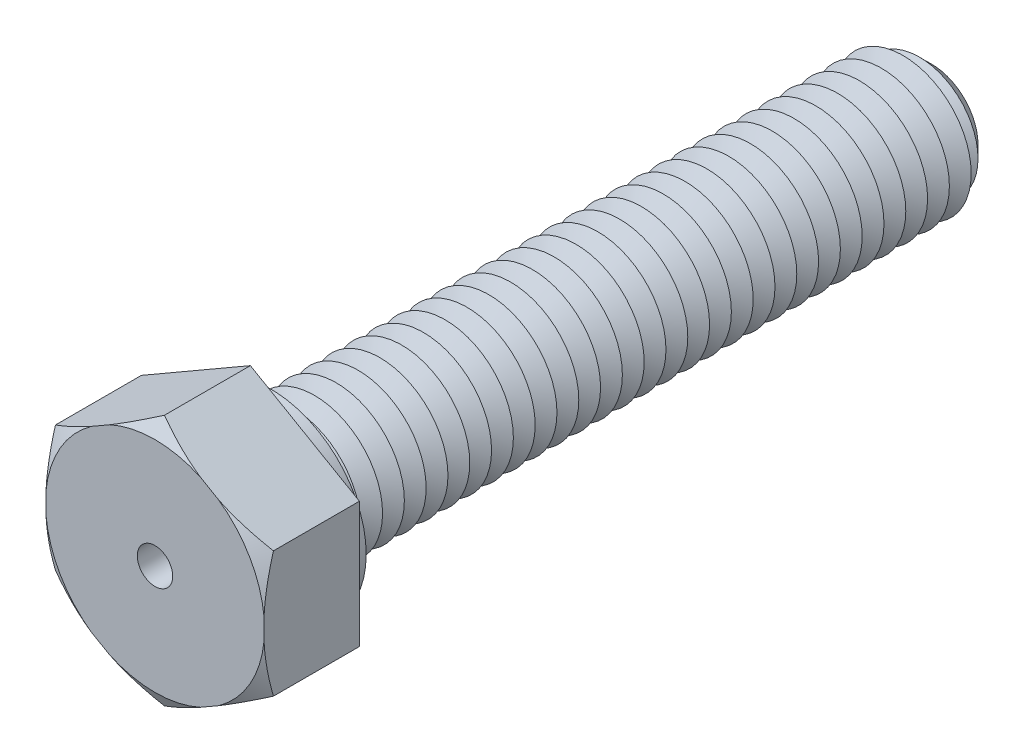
ISO-10303-21;
HEADER;
FILE_DESCRIPTION(('STEP AP214'),'2;1');
FILE_NAME('part.step','',(''),(''),'','','');
FILE_SCHEMA(('AUTOMOTIVE_DESIGN { 1 0 10303 214 1 1 1 1 }'));
ENDSEC;
DATA;
#1=APPLICATION_CONTEXT('core data for automotive mechanical design processes');
#2=APPLICATION_PROTOCOL_DEFINITION('international standard','automotive_design',2000,#1);
#3=PRODUCT_CONTEXT('',#1,'mechanical');
#4=PRODUCT('Part','Part','',(#3));
#5=PRODUCT_RELATED_PRODUCT_CATEGORY('part','',(#4));
#6=PRODUCT_DEFINITION_FORMATION('','',#4);
#7=PRODUCT_DEFINITION_CONTEXT('part definition',#1,'design');
#8=PRODUCT_DEFINITION('design','',#6,#7);
#9=PRODUCT_DEFINITION_SHAPE('','',#8);
#10=(LENGTH_UNIT() NAMED_UNIT(*) SI_UNIT(.MILLI.,.METRE.));
#11=(NAMED_UNIT(*) PLANE_ANGLE_UNIT() SI_UNIT($,.RADIAN.));
#12=(NAMED_UNIT(*) SI_UNIT($,.STERADIAN.) SOLID_ANGLE_UNIT());
#13=UNCERTAINTY_MEASURE_WITH_UNIT(LENGTH_MEASURE(1.E-05),#10,'distance_accuracy_value','');
#14=(GEOMETRIC_REPRESENTATION_CONTEXT(3) GLOBAL_UNCERTAINTY_ASSIGNED_CONTEXT((#13)) GLOBAL_UNIT_ASSIGNED_CONTEXT((#10,
#11,#12)) REPRESENTATION_CONTEXT('',''));
#15=CARTESIAN_POINT('',(0.,0.,0.));
#16=DIRECTION('',(0.,0.,1.));
#17=DIRECTION('',(1.,0.,0.));
#18=AXIS2_PLACEMENT_3D('',#15,#16,#17);
#19=CARTESIAN_POINT('',(4.,2.3094010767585,3.5));
#20=DIRECTION('',(-0.5,-0.866025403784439,0.));
#21=DIRECTION('',(0.866025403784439,-0.5,0.));
#22=AXIS2_PLACEMENT_3D('',#19,#20,#21);
#23=PLANE('',#22);
#24=CARTESIAN_POINT('',(6.77926459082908,0.704791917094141,1.88515125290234));
#25=CARTESIAN_POINT('',(6.65357706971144,0.777357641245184,1.95298106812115));
#26=CARTESIAN_POINT('',(6.52758896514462,0.850096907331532,2.02007962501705));
#27=CARTESIAN_POINT('',(6.2748848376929,0.995995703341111,2.15247084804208));
#28=CARTESIAN_POINT('',(6.14816872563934,1.06915528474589,2.21776328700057));
#29=CARTESIAN_POINT('',(5.8935057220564,1.21618503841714,2.34638757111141));
#30=CARTESIAN_POINT('',(5.76555618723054,1.29005673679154,2.40971246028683));
#31=CARTESIAN_POINT('',(5.50869902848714,1.43835328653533,2.53371033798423));
#32=CARTESIAN_POINT('',(5.37979143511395,1.51277812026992,2.59438341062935));
#33=CARTESIAN_POINT('',(5.11756014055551,1.66417742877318,2.7140043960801));
#34=CARTESIAN_POINT('',(4.98420771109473,1.74116848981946,2.77286873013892));
#35=CARTESIAN_POINT('',(4.7161724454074,1.89591872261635,2.88640197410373));
#36=CARTESIAN_POINT('',(4.58148968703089,1.97367784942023,2.94107112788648));
#37=CARTESIAN_POINT('',(4.31074083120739,2.12999477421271,3.0451841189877));
#38=CARTESIAN_POINT('',(4.17467611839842,2.20855177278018,3.09463271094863));
#39=CARTESIAN_POINT('',(3.90094921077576,2.36658807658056,3.18716064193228));
#40=CARTESIAN_POINT('',(3.76328722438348,2.44606726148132,3.23024080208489));
#41=CARTESIAN_POINT('',(3.43409497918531,2.63612649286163,3.32342391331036));
#42=CARTESIAN_POINT('',(3.24179802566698,2.74714919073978,3.37006382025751));
#43=CARTESIAN_POINT('',(2.95137883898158,2.91482278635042,3.4261412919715));
#44=CARTESIAN_POINT('',(2.85424512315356,2.97090296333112,3.44251989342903));
#45=CARTESIAN_POINT('',(2.65944416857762,3.08337134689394,3.47023794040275));
#46=CARTESIAN_POINT('',(2.56177700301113,3.13975951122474,3.48157806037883));
#47=CARTESIAN_POINT('',(2.36721602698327,3.25208934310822,3.49879538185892));
#48=CARTESIAN_POINT('',(2.27032632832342,3.30802863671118,3.50473421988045));
#49=CARTESIAN_POINT('',(2.07641108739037,3.41998565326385,3.51119583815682));
#50=CARTESIAN_POINT('',(1.97938554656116,3.47600337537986,3.51171867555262));
#51=CARTESIAN_POINT('',(1.78542763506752,3.58798502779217,3.50733170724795));
#52=CARTESIAN_POINT('',(1.68849526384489,3.64394895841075,3.50242193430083));
#53=CARTESIAN_POINT('',(1.49492986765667,3.75570399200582,3.48731840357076));
#54=CARTESIAN_POINT('',(1.39829689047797,3.81149506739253,3.47712384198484));
#55=CARTESIAN_POINT('',(1.1701117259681,3.94323783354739,3.44706969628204));
#56=CARTESIAN_POINT('',(1.03877271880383,4.01906644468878,3.42503535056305));
#57=CARTESIAN_POINT('',(0.777349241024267,4.16999935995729,3.37264454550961));
#58=CARTESIAN_POINT('',(0.64726495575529,4.24510355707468,3.34228687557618));
#59=CARTESIAN_POINT('',(0.388367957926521,4.3945778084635,3.27439527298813));
#60=CARTESIAN_POINT('',(0.259556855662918,4.46894693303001,3.2368532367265));
#61=CARTESIAN_POINT('',(0.00337956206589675,4.61685096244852,3.15577578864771));
#62=CARTESIAN_POINT('',(-0.123986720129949,4.69038591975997,3.11224075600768));
#63=CARTESIAN_POINT('',(-0.378873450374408,4.83754484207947,3.01966290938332));
#64=CARTESIAN_POINT('',(-0.506377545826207,4.91115936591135,2.97056048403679));
#65=CARTESIAN_POINT('',(-0.760034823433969,5.0576084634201,2.86822484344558));
#66=CARTESIAN_POINT('',(-0.886188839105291,5.13044351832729,2.81499436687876));
#67=CARTESIAN_POINT('',(-1.13734672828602,5.27544959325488,2.70513446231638));
#68=CARTESIAN_POINT('',(-1.26235083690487,5.34762074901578,2.6485057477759));
#69=CARTESIAN_POINT('',(-1.5113783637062,5.49139685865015,2.53244390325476));
#70=CARTESIAN_POINT('',(-1.63540176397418,5.56300180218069,2.47301072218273));
#71=CARTESIAN_POINT('',(-1.84520240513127,5.68413025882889,2.37015667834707));
#72=CARTESIAN_POINT('',(-1.93119941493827,5.73378065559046,2.32733101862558));
#73=CARTESIAN_POINT('',(-2.1028145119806,5.83286267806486,2.24068817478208));
#74=CARTESIAN_POINT('',(-2.18843261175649,5.88229431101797,2.19687102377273));
#75=CARTESIAN_POINT('',(-2.3584228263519,5.98043820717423,2.10883190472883));
#76=CARTESIAN_POINT('',(-2.44279852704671,6.02915254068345,2.06461915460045));
#77=CARTESIAN_POINT('',(-2.61124951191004,6.12640776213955,1.97543229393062));
#78=CARTESIAN_POINT('',(-2.6953247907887,6.17494864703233,1.93045817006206));
#79=CARTESIAN_POINT('',(-2.77926459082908,6.22341131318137,1.88515125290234));
#80=B_SPLINE_CURVE_WITH_KNOTS('',3,(#24,#25,#26,#27,#28,#29,#30,#31,#32,#33,#34,#35,#36,#37,#38,
#39,#40,#41,#42,#43,#44,#45,#46,#47,#48,#49,#50,#51,#52,#53,#54,#55,#56,#57,#58,#59,#60,#61,#62,
#63,#64,#65,#66,#67,#68,#69,#70,#71,#72,#73,#74,#75,#76,#77,#78,#79),.UNSPECIFIED.,.F.,.F.,(4,2,
2,2,2,2,2,2,2,2,2,2,2,2,2,2,2,2,2,2,2,2,2,2,2,2,2,4),(0.,0.480604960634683,0.96127009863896,
1.44347608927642,1.92566677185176,2.42016676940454,2.91463799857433,3.4086549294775,
3.9026081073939,4.58254272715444,4.92249867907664,5.26240911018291,5.59839013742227,
5.93436761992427,6.27034307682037,6.60636964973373,7.06584039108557,7.52537799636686,
7.98543702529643,8.44546695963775,8.91099531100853,9.37621741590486,9.84134218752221,
10.3064754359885,10.6308960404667,10.9553058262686,11.2762760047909,11.5972518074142),.UNSPECIFIED.);
#81=CARTESIAN_POINT('',(4.,2.3094010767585,3.15358983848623));
#82=VERTEX_POINT('',#81);
#83=CARTESIAN_POINT('',(2.33627081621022,3.26995556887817,3.5));
#84=VERTEX_POINT('',#83);
#85=EDGE_CURVE('E132',#82,#84,#80,.T.);
#86=ORIENTED_EDGE('',*,*,#85,.F.);
#87=DIRECTION('',(0.,0.,-1.));
#88=VECTOR('',#87,1.);
#89=CARTESIAN_POINT('',(4.,2.3094010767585,3.5));
#90=LINE('',#89,#88);
#91=CARTESIAN_POINT('',(4.,2.3094010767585,0.));
#92=VERTEX_POINT('',#91);
#93=EDGE_CURVE('E144',#82,#92,#90,.T.);
#94=ORIENTED_EDGE('',*,*,#93,.T.);
#95=DIRECTION('',(-0.866025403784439,0.5,0.));
#96=VECTOR('',#95,1.);
#97=CARTESIAN_POINT('',(4.,2.3094010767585,0.));
#98=LINE('',#97,#96);
#99=CARTESIAN_POINT('',(0.,4.618802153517,0.));
#100=VERTEX_POINT('',#99);
#101=EDGE_CURVE('E442',#92,#100,#98,.T.);
#102=ORIENTED_EDGE('',*,*,#101,.T.);
#103=DIRECTION('',(0.,0.,-1.));
#104=VECTOR('',#103,1.);
#105=CARTESIAN_POINT('',(0.,4.618802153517,3.5));
#106=LINE('',#105,#104);
#107=CARTESIAN_POINT('',(0.,4.61880215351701,3.15358983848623));
#108=VERTEX_POINT('',#107);
#109=EDGE_CURVE('E179',#108,#100,#106,.T.);
#110=ORIENTED_EDGE('',*,*,#109,.F.);
#111=CARTESIAN_POINT('',(1.66372918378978,3.65824766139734,3.5));
#112=VERTEX_POINT('',#111);
#113=EDGE_CURVE('E151',#112,#108,#80,.T.);
#114=ORIENTED_EDGE('',*,*,#113,.F.);
#115=DIRECTION('',(-0.866025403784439,0.5,0.));
#116=VECTOR('',#115,1.);
#117=CARTESIAN_POINT('',(4.,2.3094010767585,3.5));
#118=LINE('',#117,#116);
#119=EDGE_CURVE('E148',#84,#112,#118,.T.);
#120=ORIENTED_EDGE('',*,*,#119,.F.);
#121=EDGE_LOOP('',(#86,#94,#102,#110,#114,#120));
#122=FACE_BOUND('',#121,.T.);
#123=ADVANCED_FACE('F39',(#122),#23,.F.);
#124=CARTESIAN_POINT('',(0.,4.618802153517,3.5));
#125=DIRECTION('',(0.5,-0.866025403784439,0.));
#126=DIRECTION('',(0.866025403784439,0.5,0.));
#127=AXIS2_PLACEMENT_3D('',#124,#125,#126);
#128=PLANE('',#127);
#129=CARTESIAN_POINT('',(2.77926459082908,6.22341131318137,1.88515125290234));
#130=CARTESIAN_POINT('',(2.65357706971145,6.15084558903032,1.95298106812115));
#131=CARTESIAN_POINT('',(2.52758896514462,6.07810632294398,2.02007962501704));
#132=CARTESIAN_POINT('',(2.2748848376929,5.9322075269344,2.15247084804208));
#133=CARTESIAN_POINT('',(2.14816872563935,5.85904794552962,2.21776328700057));
#134=CARTESIAN_POINT('',(1.89350572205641,5.71201819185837,2.3463875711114));
#135=CARTESIAN_POINT('',(1.76555618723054,5.63814649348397,2.40971246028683));
#136=CARTESIAN_POINT('',(1.50869902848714,5.48984994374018,2.53371033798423));
#137=CARTESIAN_POINT('',(1.37979143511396,5.41542511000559,2.59438341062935));
#138=CARTESIAN_POINT('',(1.11756014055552,5.26402580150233,2.7140043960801));
#139=CARTESIAN_POINT('',(0.984207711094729,5.18703474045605,2.77286873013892));
#140=CARTESIAN_POINT('',(0.716172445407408,5.03228450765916,2.88640197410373));
#141=CARTESIAN_POINT('',(0.581489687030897,4.95452538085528,2.94107112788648));
#142=CARTESIAN_POINT('',(0.310740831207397,4.7982084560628,3.0451841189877));
#143=CARTESIAN_POINT('',(0.174676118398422,4.71965145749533,3.09463271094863));
#144=CARTESIAN_POINT('',(-0.0990507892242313,4.56161515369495,3.18716064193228));
#145=CARTESIAN_POINT('',(-0.236712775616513,4.48213596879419,3.23024080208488));
#146=CARTESIAN_POINT('',(-0.565905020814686,4.29207673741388,3.32342391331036));
#147=CARTESIAN_POINT('',(-0.758201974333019,4.18105403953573,3.37006382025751));
#148=CARTESIAN_POINT('',(-1.04862116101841,4.01338044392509,3.4261412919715));
#149=CARTESIAN_POINT('',(-1.14575487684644,3.95730026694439,3.44251989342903));
#150=CARTESIAN_POINT('',(-1.34055583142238,3.84483188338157,3.47023794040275));
#151=CARTESIAN_POINT('',(-1.43822299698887,3.78844371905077,3.48157806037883));
#152=CARTESIAN_POINT('',(-1.63278397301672,3.67611388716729,3.49879538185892));
#153=CARTESIAN_POINT('',(-1.72967367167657,3.62017459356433,3.50473421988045));
#154=CARTESIAN_POINT('',(-1.92358891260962,3.50821757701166,3.51119583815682));
#155=CARTESIAN_POINT('',(-2.02061445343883,3.45219985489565,3.51171867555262));
#156=CARTESIAN_POINT('',(-2.21457236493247,3.34021820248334,3.50733170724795));
#157=CARTESIAN_POINT('',(-2.3115047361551,3.28425427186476,3.50242193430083));
#158=CARTESIAN_POINT('',(-2.50507013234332,3.1724992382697,3.48731840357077));
#159=CARTESIAN_POINT('',(-2.60170310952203,3.11670816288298,3.47712384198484));
#160=CARTESIAN_POINT('',(-2.82988827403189,2.98496539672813,3.44706969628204));
#161=CARTESIAN_POINT('',(-2.96122728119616,2.90913678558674,3.42503535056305));
#162=CARTESIAN_POINT('',(-3.22265075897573,2.75820387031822,3.37264454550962));
#163=CARTESIAN_POINT('',(-3.3527350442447,2.68309967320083,3.34228687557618));
#164=CARTESIAN_POINT('',(-3.61163204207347,2.53362542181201,3.27439527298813));
#165=CARTESIAN_POINT('',(-3.74044314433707,2.4592562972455,3.23685323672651));
#166=CARTESIAN_POINT('',(-3.99662043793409,2.311352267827,3.15577578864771));
#167=CARTESIAN_POINT('',(-4.12398672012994,2.23781731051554,3.11224075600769));
#168=CARTESIAN_POINT('',(-4.3788734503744,2.09065838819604,3.01966290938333));
#169=CARTESIAN_POINT('',(-4.5063775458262,2.01704386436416,2.97056048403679));
#170=CARTESIAN_POINT('',(-4.76003482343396,1.87059476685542,2.86822484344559));
#171=CARTESIAN_POINT('',(-4.88618883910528,1.79775971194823,2.81499436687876));
#172=CARTESIAN_POINT('',(-5.13734672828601,1.65275363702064,2.70513446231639));
#173=CARTESIAN_POINT('',(-5.26235083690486,1.58058248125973,2.64850574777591));
#174=CARTESIAN_POINT('',(-5.51137836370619,1.43680637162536,2.53244390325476));
#175=CARTESIAN_POINT('',(-5.63540176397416,1.36520142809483,2.47301072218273));
#176=CARTESIAN_POINT('',(-5.84520240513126,1.24407297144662,2.37015667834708));
#177=CARTESIAN_POINT('',(-5.93119941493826,1.19442257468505,2.32733101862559));
#178=CARTESIAN_POINT('',(-6.1028145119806,1.09534055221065,2.24068817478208));
#179=CARTESIAN_POINT('',(-6.18843261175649,1.04590891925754,2.19687102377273));
#180=CARTESIAN_POINT('',(-6.3584228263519,0.947765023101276,2.10883190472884));
#181=CARTESIAN_POINT('',(-6.44279852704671,0.899050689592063,2.06461915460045));
#182=CARTESIAN_POINT('',(-6.61124951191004,0.80179546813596,1.97543229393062));
#183=CARTESIAN_POINT('',(-6.6953247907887,0.753254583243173,1.93045817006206));
#184=CARTESIAN_POINT('',(-6.77926459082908,0.704791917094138,1.88515125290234));
#185=B_SPLINE_CURVE_WITH_KNOTS('',3,(#129,#130,#131,#132,#133,#134,#135,#136,#137,#138,#139,
#140,#141,#142,#143,#144,#145,#146,#147,#148,#149,#150,#151,#152,#153,#154,#155,#156,#157,#158,
#159,#160,#161,#162,#163,#164,#165,#166,#167,#168,#169,#170,#171,#172,#173,#174,#175,#176,#177,
#178,#179,#180,#181,#182,#183,#184),.UNSPECIFIED.,.F.,.F.,(4,2,2,2,2,2,2,2,2,2,2,2,2,2,2,2,2,2,
2,2,2,2,2,2,2,2,2,4),(0.,0.480604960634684,0.961270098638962,1.44347608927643,1.92566677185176,
2.42016676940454,2.91463799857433,3.4086549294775,3.9026081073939,4.58254272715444,
4.92249867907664,5.26240911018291,5.59839013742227,5.93436761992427,6.27034307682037,
6.60636964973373,7.06584039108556,7.52537799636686,7.98543702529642,8.44546695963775,
8.91099531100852,9.37621741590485,9.8413421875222,10.3064754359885,10.6308960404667,
10.9553058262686,11.2762760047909,11.5972518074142),.UNSPECIFIED.);
#186=CARTESIAN_POINT('',(-1.66372918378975,3.65824766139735,3.5));
#187=VERTEX_POINT('',#186);
#188=EDGE_CURVE('E1387',#108,#187,#185,.T.);
#189=ORIENTED_EDGE('',*,*,#188,.F.);
#190=ORIENTED_EDGE('',*,*,#109,.T.);
#191=DIRECTION('',(-0.866025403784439,-0.5,0.));
#192=VECTOR('',#191,1.);
#193=CARTESIAN_POINT('',(0.,4.618802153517,0.));
#194=LINE('',#193,#192);
#195=CARTESIAN_POINT('',(-4.,2.3094010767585,0.));
#196=VERTEX_POINT('',#195);
#197=EDGE_CURVE('E461',#100,#196,#194,.T.);
#198=ORIENTED_EDGE('',*,*,#197,.T.);
#199=DIRECTION('',(0.,0.,-1.));
#200=VECTOR('',#199,1.);
#201=CARTESIAN_POINT('',(-4.,2.3094010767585,3.5));
#202=LINE('',#201,#200);
#203=CARTESIAN_POINT('',(-4.,2.3094010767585,3.15358983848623));
#204=VERTEX_POINT('',#203);
#205=EDGE_CURVE('E176',#204,#196,#202,.T.);
#206=ORIENTED_EDGE('',*,*,#205,.F.);
#207=CARTESIAN_POINT('',(-2.33627081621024,3.26995556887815,3.5));
#208=VERTEX_POINT('',#207);
#209=EDGE_CURVE('E529',#208,#204,#185,.T.);
#210=ORIENTED_EDGE('',*,*,#209,.F.);
#211=DIRECTION('',(-0.866025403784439,-0.5,0.));
#212=VECTOR('',#211,1.);
#213=CARTESIAN_POINT('',(0.,4.618802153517,3.5));
#214=LINE('',#213,#212);
#215=EDGE_CURVE('E444',#187,#208,#214,.T.);
#216=ORIENTED_EDGE('',*,*,#215,.F.);
#217=EDGE_LOOP('',(#189,#190,#198,#206,#210,#216));
#218=FACE_BOUND('',#217,.T.);
#219=ADVANCED_FACE('F538',(#218),#128,.F.);
#220=CARTESIAN_POINT('',(-4.,2.3094010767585,3.5));
#221=DIRECTION('',(1.,0.,0.));
#222=DIRECTION('',(0.,0.,-1.));
#223=AXIS2_PLACEMENT_3D('',#220,#221,#222);
#224=PLANE('',#223);
#225=CARTESIAN_POINT('',(-4.,5.08866566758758,2.08330060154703));
#226=CARTESIAN_POINT('',(-4.,4.94414615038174,2.14888120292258));
#227=CARTESIAN_POINT('',(-4.,4.79923170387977,2.21360759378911));
#228=CARTESIAN_POINT('',(-4.,4.5084433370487,2.34093771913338));
#229=CARTESIAN_POINT('',(-4.,4.36256924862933,2.4035410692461));
#230=CARTESIAN_POINT('',(-4.,4.06913305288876,2.52644280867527));
#231=CARTESIAN_POINT('',(-4.,3.92156644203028,2.58673049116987));
#232=CARTESIAN_POINT('',(-4.,3.62518774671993,2.70415001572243));
#233=CARTESIAN_POINT('',(-4.,3.47637571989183,2.76128200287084));
#234=CARTESIAN_POINT('',(-4.,3.17798204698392,2.87144502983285));
#235=CARTESIAN_POINT('',(-4.,3.02840679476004,2.92449322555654));
#236=CARTESIAN_POINT('',(-4.,2.72767549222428,3.02589725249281));
#237=CARTESIAN_POINT('',(-4.,2.57651933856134,3.07425277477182));
#238=CARTESIAN_POINT('',(-4.,2.12084922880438,3.21062944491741));
#239=CARTESIAN_POINT('',(-4.,1.81364350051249,3.29014850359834));
#240=CARTESIAN_POINT('',(-4.,1.28033133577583,3.39840613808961));
#241=CARTESIAN_POINT('',(-4.,1.05588972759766,3.43514774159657));
#242=CARTESIAN_POINT('',(-4.,0.717455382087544,3.47487260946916));
#243=CARTESIAN_POINT('',(-4.,0.604348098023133,3.48554965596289));
#244=CARTESIAN_POINT('',(-4.,0.377758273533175,3.50148677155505));
#245=CARTESIAN_POINT('',(-4.,0.264275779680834,3.50674748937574));
#246=CARTESIAN_POINT('',(-4.,0.0372413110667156,3.51168400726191));
#247=CARTESIAN_POINT('',(-4.,-0.0763106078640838,3.51136237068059));
#248=CARTESIAN_POINT('',(-4.,-0.303259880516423,3.50515259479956));
#249=CARTESIAN_POINT('',(-4.,-0.416657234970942,3.49926448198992));
#250=CARTESIAN_POINT('',(-4.,-0.643045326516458,3.48210091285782));
#251=CARTESIAN_POINT('',(-4.,-0.756036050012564,3.47082527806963));
#252=CARTESIAN_POINT('',(-4.,-0.981405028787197,3.44321260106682));
#253=CARTESIAN_POINT('',(-4.,-1.09378317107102,3.42687465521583));
#254=CARTESIAN_POINT('',(-4.,-1.54188975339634,3.35219605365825));
#255=CARTESIAN_POINT('',(-4.,-1.87460189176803,3.27522286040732));
#256=CARTESIAN_POINT('',(-4.,-2.36751874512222,3.1379521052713));
#257=CARTESIAN_POINT('',(-4.,-2.53101356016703,3.08847923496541));
#258=CARTESIAN_POINT('',(-4.,-2.85611626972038,2.98363580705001));
#259=CARTESIAN_POINT('',(-4.,-3.01772429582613,2.92826566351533));
#260=CARTESIAN_POINT('',(-4.,-3.34106601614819,2.81212836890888));
#261=CARTESIAN_POINT('',(-4.,-3.50277978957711,2.75130648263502));
#262=CARTESIAN_POINT('',(-4.,-3.82469686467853,2.62576992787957));
#263=CARTESIAN_POINT('',(-4.,-3.98490007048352,2.56105501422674));
#264=CARTESIAN_POINT('',(-4.,-4.30300593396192,2.4289095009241));
#265=CARTESIAN_POINT('',(-4.,-4.46091670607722,2.36149833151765));
#266=CARTESIAN_POINT('',(-4.,-4.7755935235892,2.22415533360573));
#267=CARTESIAN_POINT('',(-4.,-4.93235984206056,2.15422413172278));
#268=CARTESIAN_POINT('',(-4.,-5.08866566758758,2.08330060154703));
#269=B_SPLINE_CURVE_WITH_KNOTS('',3,(#225,#226,#227,#228,#229,#230,#231,#232,#233,#234,#235,
#236,#237,#238,#239,#240,#241,#242,#243,#244,#245,#246,#247,#248,#249,#250,#251,#252,#253,#254,
#255,#256,#257,#258,#259,#260,#261,#262,#263,#264,#265,#266,#267,#268),.UNSPECIFIED.,.F.,.F.,(4,
2,2,2,2,2,2,2,2,2,2,2,2,2,2,2,2,2,2,2,2,4),(0.,0.476116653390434,0.952319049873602,
1.43050831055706,1.90867556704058,2.38470991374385,2.8607755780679,3.81133518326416,
4.49276221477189,4.83347879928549,5.17415457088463,5.51467391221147,5.85519163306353,
6.19572063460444,6.53631045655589,7.5583874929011,8.07079781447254,8.58317218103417,
9.1014378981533,9.61973628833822,10.1348057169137,10.6497479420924),.UNSPECIFIED.);
#270=CARTESIAN_POINT('',(-4.,0.388292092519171,3.5));
#271=VERTEX_POINT('',#270);
#272=EDGE_CURVE('E528',#204,#271,#269,.T.);
#273=ORIENTED_EDGE('',*,*,#272,.F.);
#274=ORIENTED_EDGE('',*,*,#205,.T.);
#275=DIRECTION('',(0.,-1.,0.));
#276=VECTOR('',#275,1.);
#277=CARTESIAN_POINT('',(-4.,2.3094010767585,0.));
#278=LINE('',#277,#276);
#279=CARTESIAN_POINT('',(-4.,-2.3094010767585,0.));
#280=VERTEX_POINT('',#279);
#281=EDGE_CURVE('E465',#196,#280,#278,.T.);
#282=ORIENTED_EDGE('',*,*,#281,.T.);
#283=DIRECTION('',(0.,0.,-1.));
#284=VECTOR('',#283,1.);
#285=CARTESIAN_POINT('',(-4.,-2.3094010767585,3.5));
#286=LINE('',#285,#284);
#287=CARTESIAN_POINT('',(-4.,-2.30940107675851,3.15358983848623));
#288=VERTEX_POINT('',#287);
#289=EDGE_CURVE('E173',#288,#280,#286,.T.);
#290=ORIENTED_EDGE('',*,*,#289,.F.);
#291=CARTESIAN_POINT('',(-4.,-0.388292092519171,3.5));
#292=VERTEX_POINT('',#291);
#293=EDGE_CURVE('E522',#292,#288,#269,.T.);
#294=ORIENTED_EDGE('',*,*,#293,.F.);
#295=DIRECTION('',(0.,-1.,0.));
#296=VECTOR('',#295,1.);
#297=CARTESIAN_POINT('',(-4.,2.3094010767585,3.5));
#298=LINE('',#297,#296);
#299=EDGE_CURVE('E448',#271,#292,#298,.T.);
#300=ORIENTED_EDGE('',*,*,#299,.F.);
#301=EDGE_LOOP('',(#273,#274,#282,#290,#294,#300));
#302=FACE_BOUND('',#301,.T.);
#303=ADVANCED_FACE('F534',(#302),#224,.F.);
#304=CARTESIAN_POINT('',(-4.,-2.3094010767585,3.5));
#305=DIRECTION('',(0.5,0.866025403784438,0.));
#306=DIRECTION('',(-0.866025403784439,0.5,0.));
#307=AXIS2_PLACEMENT_3D('',#304,#305,#306);
#308=PLANE('',#307);
#309=CARTESIAN_POINT('',(-6.77926459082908,-0.704791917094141,1.88515125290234));
#310=CARTESIAN_POINT('',(-6.65357706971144,-0.777357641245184,1.95298106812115));
#311=CARTESIAN_POINT('',(-6.52758896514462,-0.850096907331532,2.02007962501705));
#312=CARTESIAN_POINT('',(-6.2748848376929,-0.995995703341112,2.15247084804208));
#313=CARTESIAN_POINT('',(-6.14816872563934,-1.06915528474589,2.21776328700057));
#314=CARTESIAN_POINT('',(-5.8935057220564,-1.21618503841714,2.34638757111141));
#315=CARTESIAN_POINT('',(-5.76555618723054,-1.29005673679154,2.40971246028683));
#316=CARTESIAN_POINT('',(-5.50869902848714,-1.43835328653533,2.53371033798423));
#317=CARTESIAN_POINT('',(-5.37979143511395,-1.51277812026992,2.59438341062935));
#318=CARTESIAN_POINT('',(-5.11756014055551,-1.66417742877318,2.71400439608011));
#319=CARTESIAN_POINT('',(-4.98420771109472,-1.74116848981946,2.77286873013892));
#320=CARTESIAN_POINT('',(-4.7161724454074,-1.89591872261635,2.88640197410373));
#321=CARTESIAN_POINT('',(-4.58148968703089,-1.97367784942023,2.94107112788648));
#322=CARTESIAN_POINT('',(-4.31074083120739,-2.12999477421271,3.0451841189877));
#323=CARTESIAN_POINT('',(-4.17467611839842,-2.20855177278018,3.09463271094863));
#324=CARTESIAN_POINT('',(-3.90094921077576,-2.36658807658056,3.18716064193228));
#325=CARTESIAN_POINT('',(-3.76328722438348,-2.44606726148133,3.23024080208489));
#326=CARTESIAN_POINT('',(-3.43409497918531,-2.63612649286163,3.32342391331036));
#327=CARTESIAN_POINT('',(-3.24179802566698,-2.74714919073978,3.3700638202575));
#328=CARTESIAN_POINT('',(-2.95137883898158,-2.91482278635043,3.4261412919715));
#329=CARTESIAN_POINT('',(-2.85424512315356,-2.97090296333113,3.44251989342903));
#330=CARTESIAN_POINT('',(-2.65944416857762,-3.08337134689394,3.47023794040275));
#331=CARTESIAN_POINT('',(-2.56177700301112,-3.13975951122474,3.48157806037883));
#332=CARTESIAN_POINT('',(-2.36721602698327,-3.25208934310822,3.49879538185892));
#333=CARTESIAN_POINT('',(-2.27032632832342,-3.30802863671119,3.50473421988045));
#334=CARTESIAN_POINT('',(-2.07641108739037,-3.41998565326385,3.51119583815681));
#335=CARTESIAN_POINT('',(-1.97938554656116,-3.47600337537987,3.51171867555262));
#336=CARTESIAN_POINT('',(-1.78542763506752,-3.58798502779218,3.50733170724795));
#337=CARTESIAN_POINT('',(-1.68849526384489,-3.64394895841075,3.50242193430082));
#338=CARTESIAN_POINT('',(-1.49492986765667,-3.75570399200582,3.48731840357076));
#339=CARTESIAN_POINT('',(-1.39829689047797,-3.81149506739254,3.47712384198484));
#340=CARTESIAN_POINT('',(-1.1701117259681,-3.94323783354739,3.44706969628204));
#341=CARTESIAN_POINT('',(-1.03877271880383,-4.01906644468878,3.42503535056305));
#342=CARTESIAN_POINT('',(-0.777349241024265,-4.1699993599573,3.37264454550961));
#343=CARTESIAN_POINT('',(-0.647264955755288,-4.24510355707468,3.34228687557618));
#344=CARTESIAN_POINT('',(-0.388367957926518,-4.39457780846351,3.27439527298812));
#345=CARTESIAN_POINT('',(-0.259556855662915,-4.46894693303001,3.2368532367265));
#346=CARTESIAN_POINT('',(-0.00337956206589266,-4.61685096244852,3.1557757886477));
#347=CARTESIAN_POINT('',(0.123986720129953,-4.69038591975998,3.11224075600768));
#348=CARTESIAN_POINT('',(0.378873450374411,-4.83754484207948,3.01966290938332));
#349=CARTESIAN_POINT('',(0.50637754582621,-4.91115936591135,2.97056048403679));
#350=CARTESIAN_POINT('',(0.760034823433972,-5.0576084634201,2.86822484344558));
#351=CARTESIAN_POINT('',(0.886188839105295,-5.13044351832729,2.81499436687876));
#352=CARTESIAN_POINT('',(1.13734672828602,-5.27544959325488,2.70513446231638));
#353=CARTESIAN_POINT('',(1.26235083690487,-5.34762074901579,2.6485057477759));
#354=CARTESIAN_POINT('',(1.5113783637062,-5.49139685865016,2.53244390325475));
#355=CARTESIAN_POINT('',(1.63540176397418,-5.56300180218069,2.47301072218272));
#356=CARTESIAN_POINT('',(1.84520240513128,-5.6841302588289,2.37015667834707));
#357=CARTESIAN_POINT('',(1.93119941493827,-5.73378065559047,2.32733101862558));
#358=CARTESIAN_POINT('',(2.10281451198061,-5.83286267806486,2.24068817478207));
#359=CARTESIAN_POINT('',(2.1884326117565,-5.88229431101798,2.19687102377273));
#360=CARTESIAN_POINT('',(2.3584228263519,-5.98043820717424,2.10883190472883));
#361=CARTESIAN_POINT('',(2.44279852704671,-6.02915254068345,2.06461915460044));
#362=CARTESIAN_POINT('',(2.61124951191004,-6.12640776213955,1.97543229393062));
#363=CARTESIAN_POINT('',(2.6953247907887,-6.17494864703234,1.93045817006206));
#364=CARTESIAN_POINT('',(2.77926459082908,-6.22341131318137,1.88515125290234));
#365=B_SPLINE_CURVE_WITH_KNOTS('',3,(#309,#310,#311,#312,#313,#314,#315,#316,#317,#318,#319,
#320,#321,#322,#323,#324,#325,#326,#327,#328,#329,#330,#331,#332,#333,#334,#335,#336,#337,#338,
#339,#340,#341,#342,#343,#344,#345,#346,#347,#348,#349,#350,#351,#352,#353,#354,#355,#356,#357,
#358,#359,#360,#361,#362,#363,#364),.UNSPECIFIED.,.F.,.F.,(4,2,2,2,2,2,2,2,2,2,2,2,2,2,2,2,2,2,
2,2,2,2,2,2,2,2,2,4),(0.,0.480604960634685,0.961270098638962,1.44347608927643,1.92566677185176,
2.42016676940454,2.91463799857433,3.4086549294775,3.90260810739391,4.58254272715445,
4.92249867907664,5.26240911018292,5.59839013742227,5.93436761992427,6.27034307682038,
6.60636964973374,7.06584039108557,7.52537799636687,7.98543702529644,8.44546695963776,
8.91099531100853,9.37621741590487,9.84134218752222,10.3064754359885,10.6308960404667,
10.9553058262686,11.2762760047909,11.5972518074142),.UNSPECIFIED.);
#366=CARTESIAN_POINT('',(-2.3362708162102,-3.26995556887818,3.5));
#367=VERTEX_POINT('',#366);
#368=EDGE_CURVE('E484',#288,#367,#365,.T.);
#369=ORIENTED_EDGE('',*,*,#368,.F.);
#370=ORIENTED_EDGE('',*,*,#289,.T.);
#371=DIRECTION('',(0.866025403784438,-0.5,0.));
#372=VECTOR('',#371,1.);
#373=CARTESIAN_POINT('',(-4.,-2.3094010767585,0.));
#374=LINE('',#373,#372);
#375=CARTESIAN_POINT('',(0.,-4.61880215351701,0.));
#376=VERTEX_POINT('',#375);
#377=EDGE_CURVE('E469',#280,#376,#374,.T.);
#378=ORIENTED_EDGE('',*,*,#377,.T.);
#379=DIRECTION('',(0.,0.,-1.));
#380=VECTOR('',#379,1.);
#381=CARTESIAN_POINT('',(0.,-4.61880215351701,3.5));
#382=LINE('',#381,#380);
#383=CARTESIAN_POINT('',(0.,-4.618802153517,3.15358983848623));
#384=VERTEX_POINT('',#383);
#385=EDGE_CURVE('E163',#384,#376,#382,.T.);
#386=ORIENTED_EDGE('',*,*,#385,.F.);
#387=CARTESIAN_POINT('',(-1.6637291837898,-3.65824766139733,3.5));
#388=VERTEX_POINT('',#387);
#389=EDGE_CURVE('E480',#388,#384,#365,.T.);
#390=ORIENTED_EDGE('',*,*,#389,.F.);
#391=DIRECTION('',(0.866025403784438,-0.5,0.));
#392=VECTOR('',#391,1.);
#393=CARTESIAN_POINT('',(-4.,-2.3094010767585,3.5));
#394=LINE('',#393,#392);
#395=EDGE_CURVE('E452',#367,#388,#394,.T.);
#396=ORIENTED_EDGE('',*,*,#395,.F.);
#397=EDGE_LOOP('',(#369,#370,#378,#386,#390,#396));
#398=FACE_BOUND('',#397,.T.);
#399=ADVANCED_FACE('F537',(#398),#308,.F.);
#400=CARTESIAN_POINT('',(0.,-4.61880215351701,3.5));
#401=DIRECTION('',(-0.5,0.866025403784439,0.));
#402=DIRECTION('',(-0.866025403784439,-0.5,0.));
#403=AXIS2_PLACEMENT_3D('',#400,#401,#402);
#404=PLANE('',#403);
#405=CARTESIAN_POINT('',(-2.77926459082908,-6.22341131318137,1.88515125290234));
#406=CARTESIAN_POINT('',(-2.65357706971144,-6.15084558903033,1.95298106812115));
#407=CARTESIAN_POINT('',(-2.52758896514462,-6.07810632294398,2.02007962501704));
#408=CARTESIAN_POINT('',(-2.2748848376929,-5.9322075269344,2.15247084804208));
#409=CARTESIAN_POINT('',(-2.14816872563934,-5.85904794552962,2.21776328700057));
#410=CARTESIAN_POINT('',(-1.8935057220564,-5.71201819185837,2.3463875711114));
#411=CARTESIAN_POINT('',(-1.76555618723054,-5.63814649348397,2.40971246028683));
#412=CARTESIAN_POINT('',(-1.50869902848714,-5.48984994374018,2.53371033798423));
#413=CARTESIAN_POINT('',(-1.37979143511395,-5.41542511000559,2.59438341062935));
#414=CARTESIAN_POINT('',(-1.11756014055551,-5.26402580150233,2.7140043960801));
#415=CARTESIAN_POINT('',(-0.984207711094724,-5.18703474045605,2.77286873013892));
#416=CARTESIAN_POINT('',(-0.716172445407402,-5.03228450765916,2.88640197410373));
#417=CARTESIAN_POINT('',(-0.581489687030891,-4.95452538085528,2.94107112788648));
#418=CARTESIAN_POINT('',(-0.310740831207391,-4.7982084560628,3.0451841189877));
#419=CARTESIAN_POINT('',(-0.174676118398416,-4.71965145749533,3.09463271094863));
#420=CARTESIAN_POINT('',(0.0990507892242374,-4.56161515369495,3.18716064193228));
#421=CARTESIAN_POINT('',(0.236712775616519,-4.48213596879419,3.23024080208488));
#422=CARTESIAN_POINT('',(0.565905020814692,-4.29207673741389,3.32342391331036));
#423=CARTESIAN_POINT('',(0.758201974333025,-4.18105403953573,3.37006382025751));
#424=CARTESIAN_POINT('',(1.04862116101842,-4.01338044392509,3.4261412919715));
#425=CARTESIAN_POINT('',(1.14575487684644,-3.95730026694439,3.44251989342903));
#426=CARTESIAN_POINT('',(1.34055583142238,-3.84483188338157,3.47023794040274));
#427=CARTESIAN_POINT('',(1.43822299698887,-3.78844371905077,3.48157806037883));
#428=CARTESIAN_POINT('',(1.63278397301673,-3.67611388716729,3.49879538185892));
#429=CARTESIAN_POINT('',(1.72967367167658,-3.62017459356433,3.50473421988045));
#430=CARTESIAN_POINT('',(1.92358891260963,-3.50821757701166,3.51119583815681));
#431=CARTESIAN_POINT('',(2.02061445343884,-3.45219985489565,3.51171867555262));
#432=CARTESIAN_POINT('',(2.21457236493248,-3.34021820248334,3.50733170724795));
#433=CARTESIAN_POINT('',(2.31150473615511,-3.28425427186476,3.50242193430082));
#434=CARTESIAN_POINT('',(2.50507013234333,-3.1724992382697,3.48731840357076));
#435=CARTESIAN_POINT('',(2.60170310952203,-3.11670816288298,3.47712384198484));
#436=CARTESIAN_POINT('',(2.8298882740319,-2.98496539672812,3.44706969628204));
#437=CARTESIAN_POINT('',(2.96122728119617,-2.90913678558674,3.42503535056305));
#438=CARTESIAN_POINT('',(3.22265075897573,-2.75820387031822,3.37264454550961));
#439=CARTESIAN_POINT('',(3.35273504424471,-2.68309967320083,3.34228687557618));
#440=CARTESIAN_POINT('',(3.61163204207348,-2.53362542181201,3.27439527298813));
#441=CARTESIAN_POINT('',(3.74044314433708,-2.4592562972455,3.2368532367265));
#442=CARTESIAN_POINT('',(3.99662043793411,-2.31135226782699,3.15577578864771));
#443=CARTESIAN_POINT('',(4.12398672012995,-2.23781731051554,3.11224075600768));
#444=CARTESIAN_POINT('',(4.37887345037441,-2.09065838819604,3.01966290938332));
#445=CARTESIAN_POINT('',(4.50637754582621,-2.01704386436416,2.97056048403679));
#446=CARTESIAN_POINT('',(4.76003482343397,-1.87059476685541,2.86822484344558));
#447=CARTESIAN_POINT('',(4.8861888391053,-1.79775971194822,2.81499436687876));
#448=CARTESIAN_POINT('',(5.13734672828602,-1.65275363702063,2.70513446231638));
#449=CARTESIAN_POINT('',(5.26235083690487,-1.58058248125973,2.6485057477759));
#450=CARTESIAN_POINT('',(5.5113783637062,-1.43680637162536,2.53244390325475));
#451=CARTESIAN_POINT('',(5.63540176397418,-1.36520142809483,2.47301072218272));
#452=CARTESIAN_POINT('',(5.84520240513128,-1.24407297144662,2.37015667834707));
#453=CARTESIAN_POINT('',(5.93119941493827,-1.19442257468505,2.32733101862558));
#454=CARTESIAN_POINT('',(6.1028145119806,-1.09534055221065,2.24068817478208));
#455=CARTESIAN_POINT('',(6.1884326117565,-1.04590891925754,2.19687102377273));
#456=CARTESIAN_POINT('',(6.3584228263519,-0.947765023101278,2.10883190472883));
#457=CARTESIAN_POINT('',(6.44279852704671,-0.899050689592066,2.06461915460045));
#458=CARTESIAN_POINT('',(6.61124951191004,-0.801795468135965,1.97543229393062));
#459=CARTESIAN_POINT('',(6.6953247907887,-0.753254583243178,1.93045817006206));
#460=CARTESIAN_POINT('',(6.77926459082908,-0.704791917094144,1.88515125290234));
#461=B_SPLINE_CURVE_WITH_KNOTS('',3,(#405,#406,#407,#408,#409,#410,#411,#412,#413,#414,#415,
#416,#417,#418,#419,#420,#421,#422,#423,#424,#425,#426,#427,#428,#429,#430,#431,#432,#433,#434,
#435,#436,#437,#438,#439,#440,#441,#442,#443,#444,#445,#446,#447,#448,#449,#450,#451,#452,#453,
#454,#455,#456,#457,#458,#459,#460),.UNSPECIFIED.,.F.,.F.,(4,2,2,2,2,2,2,2,2,2,2,2,2,2,2,2,2,2,
2,2,2,2,2,2,2,2,2,4),(0.,0.480604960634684,0.961270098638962,1.44347608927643,1.92566677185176,
2.42016676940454,2.91463799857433,3.4086549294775,3.90260810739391,4.58254272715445,
4.92249867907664,5.26240911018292,5.59839013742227,5.93436761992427,6.27034307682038,
6.60636964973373,7.06584039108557,7.52537799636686,7.98543702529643,8.44546695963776,
8.91099531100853,9.37621741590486,9.84134218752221,10.3064754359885,10.6308960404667,
10.9553058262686,11.2762760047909,11.5972518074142),.UNSPECIFIED.);
#462=CARTESIAN_POINT('',(1.6637291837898,-3.65824766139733,3.5));
#463=VERTEX_POINT('',#462);
#464=EDGE_CURVE('E64',#384,#463,#461,.T.);
#465=ORIENTED_EDGE('',*,*,#464,.F.);
#466=ORIENTED_EDGE('',*,*,#385,.T.);
#467=DIRECTION('',(0.866025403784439,0.5,0.));
#468=VECTOR('',#467,1.);
#469=CARTESIAN_POINT('',(0.,-4.61880215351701,0.));
#470=LINE('',#469,#468);
#471=CARTESIAN_POINT('',(4.,-2.30940107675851,0.));
#472=VERTEX_POINT('',#471);
#473=EDGE_CURVE('E472',#376,#472,#470,.T.);
#474=ORIENTED_EDGE('',*,*,#473,.T.);
#475=DIRECTION('',(0.,0.,-1.));
#476=VECTOR('',#475,1.);
#477=CARTESIAN_POINT('',(4.,-2.30940107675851,3.5));
#478=LINE('',#477,#476);
#479=CARTESIAN_POINT('',(4.,-2.3094010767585,3.15358983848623));
#480=VERTEX_POINT('',#479);
#481=EDGE_CURVE('E157',#480,#472,#478,.T.);
#482=ORIENTED_EDGE('',*,*,#481,.F.);
#483=CARTESIAN_POINT('',(2.3362708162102,-3.26995556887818,3.5));
#484=VERTEX_POINT('',#483);
#485=EDGE_CURVE('E481',#484,#480,#461,.T.);
#486=ORIENTED_EDGE('',*,*,#485,.F.);
#487=DIRECTION('',(0.866025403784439,0.5,0.));
#488=VECTOR('',#487,1.);
#489=CARTESIAN_POINT('',(0.,-4.61880215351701,3.5));
#490=LINE('',#489,#488);
#491=EDGE_CURVE('E166',#463,#484,#490,.T.);
#492=ORIENTED_EDGE('',*,*,#491,.F.);
#493=EDGE_LOOP('',(#465,#466,#474,#482,#486,#492));
#494=FACE_BOUND('',#493,.T.);
#495=ADVANCED_FACE('F500',(#494),#404,.F.);
#496=CARTESIAN_POINT('',(4.,-2.30940107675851,3.5));
#497=DIRECTION('',(-1.,0.,0.));
#498=DIRECTION('',(0.,0.,1.));
#499=AXIS2_PLACEMENT_3D('',#496,#497,#498);
#500=PLANE('',#499);
#501=CARTESIAN_POINT('',(4.,-5.08866566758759,2.08330060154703));
#502=CARTESIAN_POINT('',(4.,-4.94414615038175,2.14888120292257));
#503=CARTESIAN_POINT('',(4.,-4.79923170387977,2.21360759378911));
#504=CARTESIAN_POINT('',(4.,-4.50844333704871,2.34093771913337));
#505=CARTESIAN_POINT('',(4.,-4.36256924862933,2.40354106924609));
#506=CARTESIAN_POINT('',(4.,-4.06913305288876,2.52644280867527));
#507=CARTESIAN_POINT('',(4.,-3.92156644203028,2.58673049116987));
#508=CARTESIAN_POINT('',(4.,-3.62518774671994,2.70415001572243));
#509=CARTESIAN_POINT('',(4.,-3.47637571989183,2.76128200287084));
#510=CARTESIAN_POINT('',(4.,-3.17798204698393,2.87144502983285));
#511=CARTESIAN_POINT('',(4.,-3.02840679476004,2.92449322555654));
#512=CARTESIAN_POINT('',(4.,-2.72767549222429,3.02589725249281));
#513=CARTESIAN_POINT('',(4.,-2.57651933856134,3.07425277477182));
#514=CARTESIAN_POINT('',(4.,-2.12084922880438,3.21062944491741));
#515=CARTESIAN_POINT('',(4.,-1.8136435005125,3.29014850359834));
#516=CARTESIAN_POINT('',(4.,-1.28033133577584,3.39840613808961));
#517=CARTESIAN_POINT('',(4.,-1.05588972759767,3.43514774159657));
#518=CARTESIAN_POINT('',(4.,-0.71745538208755,3.47487260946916));
#519=CARTESIAN_POINT('',(4.,-0.604348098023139,3.48554965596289));
#520=CARTESIAN_POINT('',(4.,-0.377758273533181,3.50148677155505));
#521=CARTESIAN_POINT('',(4.,-0.264275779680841,3.50674748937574));
#522=CARTESIAN_POINT('',(4.,-0.0372413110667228,3.51168400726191));
#523=CARTESIAN_POINT('',(4.,0.0763106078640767,3.51136237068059));
#524=CARTESIAN_POINT('',(4.,0.303259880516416,3.50515259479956));
#525=CARTESIAN_POINT('',(4.,0.416657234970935,3.49926448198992));
#526=CARTESIAN_POINT('',(4.,0.643045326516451,3.48210091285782));
#527=CARTESIAN_POINT('',(4.,0.756036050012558,3.47082527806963));
#528=CARTESIAN_POINT('',(4.,0.98140502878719,3.44321260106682));
#529=CARTESIAN_POINT('',(4.,1.09378317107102,3.42687465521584));
#530=CARTESIAN_POINT('',(4.,1.54188975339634,3.35219605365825));
#531=CARTESIAN_POINT('',(4.,1.87460189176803,3.27522286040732));
#532=CARTESIAN_POINT('',(4.,2.36751874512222,3.1379521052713));
#533=CARTESIAN_POINT('',(4.,2.53101356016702,3.08847923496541));
#534=CARTESIAN_POINT('',(4.,2.85611626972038,2.98363580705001));
#535=CARTESIAN_POINT('',(4.,3.01772429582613,2.92826566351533));
#536=CARTESIAN_POINT('',(4.,3.34106601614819,2.81212836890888));
#537=CARTESIAN_POINT('',(4.,3.50277978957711,2.75130648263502));
#538=CARTESIAN_POINT('',(4.,3.82469686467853,2.62576992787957));
#539=CARTESIAN_POINT('',(4.,3.98490007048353,2.56105501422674));
#540=CARTESIAN_POINT('',(4.,4.30300593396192,2.4289095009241));
#541=CARTESIAN_POINT('',(4.,4.46091670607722,2.36149833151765));
#542=CARTESIAN_POINT('',(4.,4.7755935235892,2.22415533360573));
#543=CARTESIAN_POINT('',(4.,4.93235984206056,2.15422413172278));
#544=CARTESIAN_POINT('',(4.,5.08866566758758,2.08330060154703));
#545=B_SPLINE_CURVE_WITH_KNOTS('',3,(#501,#502,#503,#504,#505,#506,#507,#508,#509,#510,#511,
#512,#513,#514,#515,#516,#517,#518,#519,#520,#521,#522,#523,#524,#525,#526,#527,#528,#529,#530,
#531,#532,#533,#534,#535,#536,#537,#538,#539,#540,#541,#542,#543,#544),.UNSPECIFIED.,.F.,.F.,(4,
2,2,2,2,2,2,2,2,2,2,2,2,2,2,2,2,2,2,2,2,4),(0.,0.476116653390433,0.952319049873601,
1.43050831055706,1.90867556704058,2.38470991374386,2.8607755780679,3.81133518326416,
4.49276221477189,4.83347879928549,5.17415457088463,5.51467391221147,5.85519163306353,
6.19572063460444,6.53631045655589,7.5583874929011,8.07079781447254,8.58317218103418,
9.10143789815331,9.61973628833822,10.1348057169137,10.6497479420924),.UNSPECIFIED.);
#546=CARTESIAN_POINT('',(4.,-0.388292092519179,3.5));
#547=VERTEX_POINT('',#546);
#548=EDGE_CURVE('E56',#480,#547,#545,.T.);
#549=ORIENTED_EDGE('',*,*,#548,.F.);
#550=ORIENTED_EDGE('',*,*,#481,.T.);
#551=DIRECTION('',(0.,1.,0.));
#552=VECTOR('',#551,1.);
#553=CARTESIAN_POINT('',(4.,-2.30940107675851,0.));
#554=LINE('',#553,#552);
#555=EDGE_CURVE('E154',#472,#92,#554,.T.);
#556=ORIENTED_EDGE('',*,*,#555,.T.);
#557=ORIENTED_EDGE('',*,*,#93,.F.);
#558=CARTESIAN_POINT('',(4.,0.388292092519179,3.5));
#559=VERTEX_POINT('',#558);
#560=EDGE_CURVE('E129',#559,#82,#545,.T.);
#561=ORIENTED_EDGE('',*,*,#560,.F.);
#562=DIRECTION('',(0.,1.,0.));
#563=VECTOR('',#562,1.);
#564=CARTESIAN_POINT('',(4.,-2.30940107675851,3.5));
#565=LINE('',#564,#563);
#566=EDGE_CURVE('E158',#547,#559,#565,.T.);
#567=ORIENTED_EDGE('',*,*,#566,.F.);
#568=EDGE_LOOP('',(#549,#550,#556,#557,#561,#567));
#569=FACE_BOUND('',#568,.T.);
#570=ADVANCED_FACE('F152',(#569),#500,.F.);
#571=CARTESIAN_POINT('',(0.,0.,3.5));
#572=DIRECTION('',(0.,0.,1.));
#573=DIRECTION('',(1.,0.,0.));
#574=AXIS2_PLACEMENT_3D('',#571,#572,#573);
#575=PLANE('',#574);
#576=CARTESIAN_POINT('',(0.,0.,3.5));
#577=DIRECTION('',(0.,0.,1.));
#578=DIRECTION('',(1.,0.,0.));
#579=AXIS2_PLACEMENT_3D('',#576,#577,#578);
#580=CIRCLE('',#579,0.65);
#581=CARTESIAN_POINT('',(0.65,0.,3.5));
#582=VERTEX_POINT('',#581);
#583=EDGE_CURVE('E1376',#582,#582,#580,.T.);
#584=ORIENTED_EDGE('',*,*,#583,.F.);
#585=EDGE_LOOP('',(#584));
#586=FACE_BOUND('',#585,.T.);
#587=ORIENTED_EDGE('',*,*,#566,.T.);
#588=CARTESIAN_POINT('',(0.,0.,3.5));
#589=DIRECTION('',(0.,0.,1.));
#590=DIRECTION('',(1.,0.,0.));
#591=AXIS2_PLACEMENT_3D('',#588,#589,#590);
#592=CIRCLE('',#591,4.018802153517);
#593=EDGE_CURVE('E134',#559,#84,#592,.T.);
#594=ORIENTED_EDGE('',*,*,#593,.T.);
#595=ORIENTED_EDGE('',*,*,#119,.T.);
#596=CARTESIAN_POINT('',(0.,0.,3.5));
#597=DIRECTION('',(0.,0.,1.));
#598=DIRECTION('',(1.,0.,0.));
#599=AXIS2_PLACEMENT_3D('',#596,#597,#598);
#600=CIRCLE('',#599,4.018802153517);
#601=EDGE_CURVE('E11',#112,#187,#600,.T.);
#602=ORIENTED_EDGE('',*,*,#601,.T.);
#603=ORIENTED_EDGE('',*,*,#215,.T.);
#604=EDGE_CURVE('E49',#208,#271,#600,.T.);
#605=ORIENTED_EDGE('',*,*,#604,.T.);
#606=ORIENTED_EDGE('',*,*,#299,.T.);
#607=EDGE_CURVE('E1400',#292,#367,#600,.T.);
#608=ORIENTED_EDGE('',*,*,#607,.T.);
#609=ORIENTED_EDGE('',*,*,#395,.T.);
#610=EDGE_CURVE('E1407',#388,#463,#600,.T.);
#611=ORIENTED_EDGE('',*,*,#610,.T.);
#612=ORIENTED_EDGE('',*,*,#491,.T.);
#613=EDGE_CURVE('E43',#484,#547,#600,.T.);
#614=ORIENTED_EDGE('',*,*,#613,.T.);
#615=EDGE_LOOP('',(#587,#594,#595,#602,#603,#605,#606,#608,#609,#611,#612,#614));
#616=FACE_BOUND('',#615,.T.);
#617=ADVANCED_FACE('F568',(#586,#616),#575,.T.);
#618=CARTESIAN_POINT('',(0.,0.,0.));
#619=DIRECTION('',(0.,0.,1.));
#620=DIRECTION('',(1.,0.,0.));
#621=AXIS2_PLACEMENT_3D('',#618,#619,#620);
#622=PLANE('',#621);
#623=CARTESIAN_POINT('',(0.,0.,0.));
#624=DIRECTION('',(0.,0.,1.));
#625=DIRECTION('',(1.,0.,0.));
#626=AXIS2_PLACEMENT_3D('',#623,#624,#625);
#627=CIRCLE('',#626,3.5);
#628=CARTESIAN_POINT('',(3.5,0.,0.));
#629=VERTEX_POINT('',#628);
#630=EDGE_CURVE('E182',#629,#629,#627,.F.);
#631=ORIENTED_EDGE('',*,*,#630,.F.);
#632=EDGE_LOOP('',(#631));
#633=FACE_BOUND('',#632,.T.);
#634=ORIENTED_EDGE('',*,*,#101,.F.);
#635=ORIENTED_EDGE('',*,*,#555,.F.);
#636=ORIENTED_EDGE('',*,*,#473,.F.);
#637=ORIENTED_EDGE('',*,*,#377,.F.);
#638=ORIENTED_EDGE('',*,*,#281,.F.);
#639=ORIENTED_EDGE('',*,*,#197,.F.);
#640=EDGE_LOOP('',(#634,#635,#636,#637,#638,#639));
#641=FACE_BOUND('',#640,.T.);
#642=ADVANCED_FACE('F573',(#633,#641),#622,.F.);
#643=CARTESIAN_POINT('',(0.,0.,-0.75));
#644=DIRECTION('',(0.,0.,1.));
#645=DIRECTION('',(1.,0.,0.));
#646=AXIS2_PLACEMENT_3D('',#643,#644,#645);
#647=CYLINDRICAL_SURFACE('',#646,3.5);
#648=CARTESIAN_POINT('',(0.,0.,-0.75));
#649=DIRECTION('',(0.,0.,-1.));
#650=DIRECTION('',(-1.,0.,0.));
#651=AXIS2_PLACEMENT_3D('',#648,#649,#650);
#652=CIRCLE('',#651,3.5);
#653=CARTESIAN_POINT('',(-3.5,0.,-0.75));
#654=VERTEX_POINT('',#653);
#655=EDGE_CURVE('E438',#654,#654,#652,.T.);
#656=ORIENTED_EDGE('',*,*,#655,.F.);
#657=EDGE_LOOP('',(#656));
#658=FACE_BOUND('',#657,.T.);
#659=ORIENTED_EDGE('',*,*,#630,.T.);
#660=EDGE_LOOP('',(#659));
#661=FACE_BOUND('',#660,.T.);
#662=ADVANCED_FACE('F580',(#658,#661),#647,.T.);
#663=CARTESIAN_POINT('',(0.,0.,-0.75));
#664=DIRECTION('',(0.,0.,-1.));
#665=DIRECTION('',(-1.,0.,0.));
#666=AXIS2_PLACEMENT_3D('',#663,#664,#665);
#667=PLANE('',#666);
#668=CARTESIAN_POINT('',(0.,0.,-0.750000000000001));
#669=DIRECTION('',(0.,0.,1.));
#670=DIRECTION('',(1.,0.,0.));
#671=AXIS2_PLACEMENT_3D('',#668,#669,#670);
#672=CIRCLE('',#671,2.5);
#673=CARTESIAN_POINT('',(2.5,0.,-0.750000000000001));
#674=VERTEX_POINT('',#673);
#675=EDGE_CURVE('E435',#674,#674,#672,.T.);
#676=ORIENTED_EDGE('',*,*,#675,.T.);
#677=EDGE_LOOP('',(#676));
#678=FACE_BOUND('',#677,.T.);
#679=ORIENTED_EDGE('',*,*,#655,.T.);
#680=EDGE_LOOP('',(#679));
#681=FACE_BOUND('',#680,.T.);
#682=ADVANCED_FACE('F587',(#678,#681),#667,.T.);
#683=CARTESIAN_POINT('',(0.,0.,-0.750000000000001));
#684=DIRECTION('',(0.,0.,1.));
#685=DIRECTION('',(1.,0.,0.));
#686=AXIS2_PLACEMENT_3D('',#683,#684,#685);
#687=CONICAL_SURFACE('',#686,2.5,1.0471975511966);
#688=CARTESIAN_POINT('',(0.,0.,-1.15));
#689=DIRECTION('',(0.,0.,1.));
#690=DIRECTION('',(1.,0.,0.));
#691=AXIS2_PLACEMENT_3D('',#688,#689,#690);
#692=CIRCLE('',#691,1.80717967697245);
#693=CARTESIAN_POINT('',(1.80717967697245,0.,-1.15));
#694=VERTEX_POINT('',#693);
#695=EDGE_CURVE('E431',#694,#694,#692,.T.);
#696=ORIENTED_EDGE('',*,*,#695,.T.);
#697=EDGE_LOOP('',(#696));
#698=FACE_BOUND('',#697,.T.);
#699=ORIENTED_EDGE('',*,*,#675,.F.);
#700=EDGE_LOOP('',(#699));
#701=FACE_BOUND('',#700,.T.);
#702=ADVANCED_FACE('F594',(#698,#701),#687,.T.);
#703=CARTESIAN_POINT('',(0.,0.,-1.15));
#704=DIRECTION('',(0.,0.,-1.));
#705=DIRECTION('',(-1.,0.,0.));
#706=AXIS2_PLACEMENT_3D('',#703,#704,#705);
#707=CONICAL_SURFACE('',#706,1.80717967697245,1.0471975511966);
#708=CARTESIAN_POINT('',(0.,0.,-1.55));
#709=DIRECTION('',(0.,0.,1.));
#710=DIRECTION('',(1.,0.,0.));
#711=AXIS2_PLACEMENT_3D('',#708,#709,#710);
#712=CIRCLE('',#711,2.5);
#713=CARTESIAN_POINT('',(2.5,0.,-1.55));
#714=VERTEX_POINT('',#713);
#715=EDGE_CURVE('E427',#714,#714,#712,.T.);
#716=ORIENTED_EDGE('',*,*,#715,.T.);
#717=EDGE_LOOP('',(#716));
#718=FACE_BOUND('',#717,.T.);
#719=ORIENTED_EDGE('',*,*,#695,.F.);
#720=EDGE_LOOP('',(#719));
#721=FACE_BOUND('',#720,.T.);
#722=ADVANCED_FACE('F601',(#718,#721),#707,.T.);
#723=CARTESIAN_POINT('',(0.,0.,-1.55));
#724=DIRECTION('',(0.,0.,1.));
#725=DIRECTION('',(1.,0.,0.));
#726=AXIS2_PLACEMENT_3D('',#723,#724,#725);
#727=CONICAL_SURFACE('',#726,2.5,1.0471975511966);
#728=CARTESIAN_POINT('',(0.,0.,-1.95));
#729=DIRECTION('',(0.,0.,1.));
#730=DIRECTION('',(1.,0.,0.));
#731=AXIS2_PLACEMENT_3D('',#728,#729,#730);
#732=CIRCLE('',#731,1.80717967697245);
#733=CARTESIAN_POINT('',(1.80717967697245,0.,-1.95));
#734=VERTEX_POINT('',#733);
#735=EDGE_CURVE('E423',#734,#734,#732,.T.);
#736=ORIENTED_EDGE('',*,*,#735,.T.);
#737=EDGE_LOOP('',(#736));
#738=FACE_BOUND('',#737,.T.);
#739=ORIENTED_EDGE('',*,*,#715,.F.);
#740=EDGE_LOOP('',(#739));
#741=FACE_BOUND('',#740,.T.);
#742=ADVANCED_FACE('F608',(#738,#741),#727,.T.);
#743=CARTESIAN_POINT('',(0.,0.,-1.95));
#744=DIRECTION('',(0.,0.,-1.));
#745=DIRECTION('',(-1.,0.,0.));
#746=AXIS2_PLACEMENT_3D('',#743,#744,#745);
#747=CONICAL_SURFACE('',#746,1.80717967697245,1.0471975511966);
#748=CARTESIAN_POINT('',(0.,0.,-2.35));
#749=DIRECTION('',(0.,0.,1.));
#750=DIRECTION('',(1.,0.,0.));
#751=AXIS2_PLACEMENT_3D('',#748,#749,#750);
#752=CIRCLE('',#751,2.5);
#753=CARTESIAN_POINT('',(2.5,0.,-2.35));
#754=VERTEX_POINT('',#753);
#755=EDGE_CURVE('E419',#754,#754,#752,.T.);
#756=ORIENTED_EDGE('',*,*,#755,.T.);
#757=EDGE_LOOP('',(#756));
#758=FACE_BOUND('',#757,.T.);
#759=ORIENTED_EDGE('',*,*,#735,.F.);
#760=EDGE_LOOP('',(#759));
#761=FACE_BOUND('',#760,.T.);
#762=ADVANCED_FACE('F615',(#758,#761),#747,.T.);
#763=CARTESIAN_POINT('',(0.,0.,-2.35));
#764=DIRECTION('',(0.,0.,1.));
#765=DIRECTION('',(1.,0.,0.));
#766=AXIS2_PLACEMENT_3D('',#763,#764,#765);
#767=CONICAL_SURFACE('',#766,2.5,1.0471975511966);
#768=CARTESIAN_POINT('',(0.,0.,-2.75));
#769=DIRECTION('',(0.,0.,1.));
#770=DIRECTION('',(1.,0.,0.));
#771=AXIS2_PLACEMENT_3D('',#768,#769,#770);
#772=CIRCLE('',#771,1.80717967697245);
#773=CARTESIAN_POINT('',(1.80717967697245,0.,-2.75));
#774=VERTEX_POINT('',#773);
#775=EDGE_CURVE('E415',#774,#774,#772,.T.);
#776=ORIENTED_EDGE('',*,*,#775,.T.);
#777=EDGE_LOOP('',(#776));
#778=FACE_BOUND('',#777,.T.);
#779=ORIENTED_EDGE('',*,*,#755,.F.);
#780=EDGE_LOOP('',(#779));
#781=FACE_BOUND('',#780,.T.);
#782=ADVANCED_FACE('F622',(#778,#781),#767,.T.);
#783=CARTESIAN_POINT('',(0.,0.,-2.75));
#784=DIRECTION('',(0.,0.,-1.));
#785=DIRECTION('',(-1.,0.,0.));
#786=AXIS2_PLACEMENT_3D('',#783,#784,#785);
#787=CONICAL_SURFACE('',#786,1.80717967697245,1.0471975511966);
#788=CARTESIAN_POINT('',(0.,0.,-3.15));
#789=DIRECTION('',(0.,0.,1.));
#790=DIRECTION('',(1.,0.,0.));
#791=AXIS2_PLACEMENT_3D('',#788,#789,#790);
#792=CIRCLE('',#791,2.5);
#793=CARTESIAN_POINT('',(2.5,0.,-3.15));
#794=VERTEX_POINT('',#793);
#795=EDGE_CURVE('E411',#794,#794,#792,.T.);
#796=ORIENTED_EDGE('',*,*,#795,.T.);
#797=EDGE_LOOP('',(#796));
#798=FACE_BOUND('',#797,.T.);
#799=ORIENTED_EDGE('',*,*,#775,.F.);
#800=EDGE_LOOP('',(#799));
#801=FACE_BOUND('',#800,.T.);
#802=ADVANCED_FACE('F629',(#798,#801),#787,.T.);
#803=CARTESIAN_POINT('',(0.,0.,-3.15));
#804=DIRECTION('',(0.,0.,1.));
#805=DIRECTION('',(1.,0.,0.));
#806=AXIS2_PLACEMENT_3D('',#803,#804,#805);
#807=CONICAL_SURFACE('',#806,2.5,1.0471975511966);
#808=CARTESIAN_POINT('',(0.,0.,-3.55));
#809=DIRECTION('',(0.,0.,1.));
#810=DIRECTION('',(1.,0.,0.));
#811=AXIS2_PLACEMENT_3D('',#808,#809,#810);
#812=CIRCLE('',#811,1.80717967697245);
#813=CARTESIAN_POINT('',(1.80717967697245,0.,-3.55));
#814=VERTEX_POINT('',#813);
#815=EDGE_CURVE('E407',#814,#814,#812,.T.);
#816=ORIENTED_EDGE('',*,*,#815,.T.);
#817=EDGE_LOOP('',(#816));
#818=FACE_BOUND('',#817,.T.);
#819=ORIENTED_EDGE('',*,*,#795,.F.);
#820=EDGE_LOOP('',(#819));
#821=FACE_BOUND('',#820,.T.);
#822=ADVANCED_FACE('F636',(#818,#821),#807,.T.);
#823=CARTESIAN_POINT('',(0.,0.,-3.55));
#824=DIRECTION('',(0.,0.,-1.));
#825=DIRECTION('',(-1.,0.,0.));
#826=AXIS2_PLACEMENT_3D('',#823,#824,#825);
#827=CONICAL_SURFACE('',#826,1.80717967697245,1.0471975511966);
#828=CARTESIAN_POINT('',(0.,0.,-3.95));
#829=DIRECTION('',(0.,0.,1.));
#830=DIRECTION('',(1.,0.,0.));
#831=AXIS2_PLACEMENT_3D('',#828,#829,#830);
#832=CIRCLE('',#831,2.5);
#833=CARTESIAN_POINT('',(2.5,0.,-3.95));
#834=VERTEX_POINT('',#833);
#835=EDGE_CURVE('E403',#834,#834,#832,.T.);
#836=ORIENTED_EDGE('',*,*,#835,.T.);
#837=EDGE_LOOP('',(#836));
#838=FACE_BOUND('',#837,.T.);
#839=ORIENTED_EDGE('',*,*,#815,.F.);
#840=EDGE_LOOP('',(#839));
#841=FACE_BOUND('',#840,.T.);
#842=ADVANCED_FACE('F643',(#838,#841),#827,.T.);
#843=CARTESIAN_POINT('',(0.,0.,-3.95));
#844=DIRECTION('',(0.,0.,1.));
#845=DIRECTION('',(1.,0.,0.));
#846=AXIS2_PLACEMENT_3D('',#843,#844,#845);
#847=CONICAL_SURFACE('',#846,2.5,1.0471975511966);
#848=CARTESIAN_POINT('',(0.,0.,-4.35));
#849=DIRECTION('',(0.,0.,1.));
#850=DIRECTION('',(1.,0.,0.));
#851=AXIS2_PLACEMENT_3D('',#848,#849,#850);
#852=CIRCLE('',#851,1.80717967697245);
#853=CARTESIAN_POINT('',(1.80717967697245,0.,-4.35));
#854=VERTEX_POINT('',#853);
#855=EDGE_CURVE('E399',#854,#854,#852,.T.);
#856=ORIENTED_EDGE('',*,*,#855,.T.);
#857=EDGE_LOOP('',(#856));
#858=FACE_BOUND('',#857,.T.);
#859=ORIENTED_EDGE('',*,*,#835,.F.);
#860=EDGE_LOOP('',(#859));
#861=FACE_BOUND('',#860,.T.);
#862=ADVANCED_FACE('F650',(#858,#861),#847,.T.);
#863=CARTESIAN_POINT('',(0.,0.,-4.35));
#864=DIRECTION('',(0.,0.,-1.));
#865=DIRECTION('',(-1.,0.,0.));
#866=AXIS2_PLACEMENT_3D('',#863,#864,#865);
#867=CONICAL_SURFACE('',#866,1.80717967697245,1.0471975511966);
#868=CARTESIAN_POINT('',(0.,0.,-4.75));
#869=DIRECTION('',(0.,0.,1.));
#870=DIRECTION('',(1.,0.,0.));
#871=AXIS2_PLACEMENT_3D('',#868,#869,#870);
#872=CIRCLE('',#871,2.5);
#873=CARTESIAN_POINT('',(2.5,0.,-4.75));
#874=VERTEX_POINT('',#873);
#875=EDGE_CURVE('E395',#874,#874,#872,.T.);
#876=ORIENTED_EDGE('',*,*,#875,.T.);
#877=EDGE_LOOP('',(#876));
#878=FACE_BOUND('',#877,.T.);
#879=ORIENTED_EDGE('',*,*,#855,.F.);
#880=EDGE_LOOP('',(#879));
#881=FACE_BOUND('',#880,.T.);
#882=ADVANCED_FACE('F657',(#878,#881),#867,.T.);
#883=CARTESIAN_POINT('',(0.,0.,-4.75));
#884=DIRECTION('',(0.,0.,1.));
#885=DIRECTION('',(1.,0.,0.));
#886=AXIS2_PLACEMENT_3D('',#883,#884,#885);
#887=CONICAL_SURFACE('',#886,2.5,1.0471975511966);
#888=CARTESIAN_POINT('',(0.,0.,-5.15));
#889=DIRECTION('',(0.,0.,1.));
#890=DIRECTION('',(1.,0.,0.));
#891=AXIS2_PLACEMENT_3D('',#888,#889,#890);
#892=CIRCLE('',#891,1.80717967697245);
#893=CARTESIAN_POINT('',(1.80717967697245,0.,-5.15));
#894=VERTEX_POINT('',#893);
#895=EDGE_CURVE('E391',#894,#894,#892,.T.);
#896=ORIENTED_EDGE('',*,*,#895,.T.);
#897=EDGE_LOOP('',(#896));
#898=FACE_BOUND('',#897,.T.);
#899=ORIENTED_EDGE('',*,*,#875,.F.);
#900=EDGE_LOOP('',(#899));
#901=FACE_BOUND('',#900,.T.);
#902=ADVANCED_FACE('F664',(#898,#901),#887,.T.);
#903=CARTESIAN_POINT('',(0.,0.,-5.15));
#904=DIRECTION('',(0.,0.,-1.));
#905=DIRECTION('',(-1.,0.,0.));
#906=AXIS2_PLACEMENT_3D('',#903,#904,#905);
#907=CONICAL_SURFACE('',#906,1.80717967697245,1.0471975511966);
#908=CARTESIAN_POINT('',(0.,0.,-5.55));
#909=DIRECTION('',(0.,0.,1.));
#910=DIRECTION('',(1.,0.,0.));
#911=AXIS2_PLACEMENT_3D('',#908,#909,#910);
#912=CIRCLE('',#911,2.5);
#913=CARTESIAN_POINT('',(2.5,0.,-5.55));
#914=VERTEX_POINT('',#913);
#915=EDGE_CURVE('E387',#914,#914,#912,.T.);
#916=ORIENTED_EDGE('',*,*,#915,.T.);
#917=EDGE_LOOP('',(#916));
#918=FACE_BOUND('',#917,.T.);
#919=ORIENTED_EDGE('',*,*,#895,.F.);
#920=EDGE_LOOP('',(#919));
#921=FACE_BOUND('',#920,.T.);
#922=ADVANCED_FACE('F671',(#918,#921),#907,.T.);
#923=CARTESIAN_POINT('',(0.,0.,-5.55));
#924=DIRECTION('',(0.,0.,1.));
#925=DIRECTION('',(1.,0.,0.));
#926=AXIS2_PLACEMENT_3D('',#923,#924,#925);
#927=CONICAL_SURFACE('',#926,2.5,1.0471975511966);
#928=CARTESIAN_POINT('',(0.,0.,-5.95));
#929=DIRECTION('',(0.,0.,1.));
#930=DIRECTION('',(1.,0.,0.));
#931=AXIS2_PLACEMENT_3D('',#928,#929,#930);
#932=CIRCLE('',#931,1.80717967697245);
#933=CARTESIAN_POINT('',(1.80717967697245,0.,-5.95));
#934=VERTEX_POINT('',#933);
#935=EDGE_CURVE('E383',#934,#934,#932,.T.);
#936=ORIENTED_EDGE('',*,*,#935,.T.);
#937=EDGE_LOOP('',(#936));
#938=FACE_BOUND('',#937,.T.);
#939=ORIENTED_EDGE('',*,*,#915,.F.);
#940=EDGE_LOOP('',(#939));
#941=FACE_BOUND('',#940,.T.);
#942=ADVANCED_FACE('F678',(#938,#941),#927,.T.);
#943=CARTESIAN_POINT('',(0.,0.,-5.95));
#944=DIRECTION('',(0.,0.,-1.));
#945=DIRECTION('',(-1.,0.,0.));
#946=AXIS2_PLACEMENT_3D('',#943,#944,#945);
#947=CONICAL_SURFACE('',#946,1.80717967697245,1.0471975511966);
#948=CARTESIAN_POINT('',(0.,0.,-6.35));
#949=DIRECTION('',(0.,0.,1.));
#950=DIRECTION('',(1.,0.,0.));
#951=AXIS2_PLACEMENT_3D('',#948,#949,#950);
#952=CIRCLE('',#951,2.5);
#953=CARTESIAN_POINT('',(2.5,0.,-6.35));
#954=VERTEX_POINT('',#953);
#955=EDGE_CURVE('E379',#954,#954,#952,.T.);
#956=ORIENTED_EDGE('',*,*,#955,.T.);
#957=EDGE_LOOP('',(#956));
#958=FACE_BOUND('',#957,.T.);
#959=ORIENTED_EDGE('',*,*,#935,.F.);
#960=EDGE_LOOP('',(#959));
#961=FACE_BOUND('',#960,.T.);
#962=ADVANCED_FACE('F685',(#958,#961),#947,.T.);
#963=CARTESIAN_POINT('',(0.,0.,-6.35));
#964=DIRECTION('',(0.,0.,1.));
#965=DIRECTION('',(1.,0.,0.));
#966=AXIS2_PLACEMENT_3D('',#963,#964,#965);
#967=CONICAL_SURFACE('',#966,2.5,1.0471975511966);
#968=CARTESIAN_POINT('',(0.,0.,-6.75));
#969=DIRECTION('',(0.,0.,1.));
#970=DIRECTION('',(1.,0.,0.));
#971=AXIS2_PLACEMENT_3D('',#968,#969,#970);
#972=CIRCLE('',#971,1.80717967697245);
#973=CARTESIAN_POINT('',(1.80717967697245,0.,-6.75));
#974=VERTEX_POINT('',#973);
#975=EDGE_CURVE('E376',#974,#974,#972,.T.);
#976=ORIENTED_EDGE('',*,*,#975,.T.);
#977=EDGE_LOOP('',(#976));
#978=FACE_BOUND('',#977,.T.);
#979=ORIENTED_EDGE('',*,*,#955,.F.);
#980=EDGE_LOOP('',(#979));
#981=FACE_BOUND('',#980,.T.);
#982=ADVANCED_FACE('F692',(#978,#981),#967,.T.);
#983=CARTESIAN_POINT('',(0.,0.,-6.75));
#984=DIRECTION('',(0.,0.,-1.));
#985=DIRECTION('',(-1.,0.,0.));
#986=AXIS2_PLACEMENT_3D('',#983,#984,#985);
#987=CONICAL_SURFACE('',#986,1.80717967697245,1.0471975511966);
#988=CARTESIAN_POINT('',(0.,0.,-7.15));
#989=DIRECTION('',(0.,0.,1.));
#990=DIRECTION('',(1.,0.,0.));
#991=AXIS2_PLACEMENT_3D('',#988,#989,#990);
#992=CIRCLE('',#991,2.5);
#993=CARTESIAN_POINT('',(2.5,0.,-7.15));
#994=VERTEX_POINT('',#993);
#995=EDGE_CURVE('E372',#994,#994,#992,.T.);
#996=ORIENTED_EDGE('',*,*,#995,.T.);
#997=EDGE_LOOP('',(#996));
#998=FACE_BOUND('',#997,.T.);
#999=ORIENTED_EDGE('',*,*,#975,.F.);
#1000=EDGE_LOOP('',(#999));
#1001=FACE_BOUND('',#1000,.T.);
#1002=ADVANCED_FACE('F699',(#998,#1001),#987,.T.);
#1003=CARTESIAN_POINT('',(0.,0.,-7.15));
#1004=DIRECTION('',(0.,0.,1.));
#1005=DIRECTION('',(1.,0.,0.));
#1006=AXIS2_PLACEMENT_3D('',#1003,#1004,#1005);
#1007=CONICAL_SURFACE('',#1006,2.5,1.0471975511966);
#1008=CARTESIAN_POINT('',(0.,0.,-7.55));
#1009=DIRECTION('',(0.,0.,1.));
#1010=DIRECTION('',(1.,0.,0.));
#1011=AXIS2_PLACEMENT_3D('',#1008,#1009,#1010);
#1012=CIRCLE('',#1011,1.80717967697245);
#1013=CARTESIAN_POINT('',(1.80717967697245,0.,-7.55));
#1014=VERTEX_POINT('',#1013);
#1015=EDGE_CURVE('E368',#1014,#1014,#1012,.T.);
#1016=ORIENTED_EDGE('',*,*,#1015,.T.);
#1017=EDGE_LOOP('',(#1016));
#1018=FACE_BOUND('',#1017,.T.);
#1019=ORIENTED_EDGE('',*,*,#995,.F.);
#1020=EDGE_LOOP('',(#1019));
#1021=FACE_BOUND('',#1020,.T.);
#1022=ADVANCED_FACE('F706',(#1018,#1021),#1007,.T.);
#1023=CARTESIAN_POINT('',(0.,0.,-7.55));
#1024=DIRECTION('',(0.,0.,-1.));
#1025=DIRECTION('',(-1.,0.,0.));
#1026=AXIS2_PLACEMENT_3D('',#1023,#1024,#1025);
#1027=CONICAL_SURFACE('',#1026,1.80717967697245,1.0471975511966);
#1028=CARTESIAN_POINT('',(0.,0.,-7.95));
#1029=DIRECTION('',(0.,0.,1.));
#1030=DIRECTION('',(1.,0.,0.));
#1031=AXIS2_PLACEMENT_3D('',#1028,#1029,#1030);
#1032=CIRCLE('',#1031,2.5);
#1033=CARTESIAN_POINT('',(2.5,0.,-7.95));
#1034=VERTEX_POINT('',#1033);
#1035=EDGE_CURVE('E364',#1034,#1034,#1032,.T.);
#1036=ORIENTED_EDGE('',*,*,#1035,.T.);
#1037=EDGE_LOOP('',(#1036));
#1038=FACE_BOUND('',#1037,.T.);
#1039=ORIENTED_EDGE('',*,*,#1015,.F.);
#1040=EDGE_LOOP('',(#1039));
#1041=FACE_BOUND('',#1040,.T.);
#1042=ADVANCED_FACE('F713',(#1038,#1041),#1027,.T.);
#1043=CARTESIAN_POINT('',(0.,0.,-7.95));
#1044=DIRECTION('',(0.,0.,1.));
#1045=DIRECTION('',(1.,0.,0.));
#1046=AXIS2_PLACEMENT_3D('',#1043,#1044,#1045);
#1047=CONICAL_SURFACE('',#1046,2.5,1.0471975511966);
#1048=CARTESIAN_POINT('',(0.,0.,-8.35));
#1049=DIRECTION('',(0.,0.,1.));
#1050=DIRECTION('',(1.,0.,0.));
#1051=AXIS2_PLACEMENT_3D('',#1048,#1049,#1050);
#1052=CIRCLE('',#1051,1.80717967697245);
#1053=CARTESIAN_POINT('',(1.80717967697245,0.,-8.35));
#1054=VERTEX_POINT('',#1053);
#1055=EDGE_CURVE('E360',#1054,#1054,#1052,.T.);
#1056=ORIENTED_EDGE('',*,*,#1055,.T.);
#1057=EDGE_LOOP('',(#1056));
#1058=FACE_BOUND('',#1057,.T.);
#1059=ORIENTED_EDGE('',*,*,#1035,.F.);
#1060=EDGE_LOOP('',(#1059));
#1061=FACE_BOUND('',#1060,.T.);
#1062=ADVANCED_FACE('F720',(#1058,#1061),#1047,.T.);
#1063=CARTESIAN_POINT('',(0.,0.,-8.35));
#1064=DIRECTION('',(0.,0.,-1.));
#1065=DIRECTION('',(-1.,0.,0.));
#1066=AXIS2_PLACEMENT_3D('',#1063,#1064,#1065);
#1067=CONICAL_SURFACE('',#1066,1.80717967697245,1.0471975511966);
#1068=CARTESIAN_POINT('',(0.,0.,-8.75));
#1069=DIRECTION('',(0.,0.,1.));
#1070=DIRECTION('',(1.,0.,0.));
#1071=AXIS2_PLACEMENT_3D('',#1068,#1069,#1070);
#1072=CIRCLE('',#1071,2.5);
#1073=CARTESIAN_POINT('',(2.5,0.,-8.75));
#1074=VERTEX_POINT('',#1073);
#1075=EDGE_CURVE('E356',#1074,#1074,#1072,.T.);
#1076=ORIENTED_EDGE('',*,*,#1075,.T.);
#1077=EDGE_LOOP('',(#1076));
#1078=FACE_BOUND('',#1077,.T.);
#1079=ORIENTED_EDGE('',*,*,#1055,.F.);
#1080=EDGE_LOOP('',(#1079));
#1081=FACE_BOUND('',#1080,.T.);
#1082=ADVANCED_FACE('F727',(#1078,#1081),#1067,.T.);
#1083=CARTESIAN_POINT('',(0.,0.,-8.75));
#1084=DIRECTION('',(0.,0.,1.));
#1085=DIRECTION('',(1.,0.,0.));
#1086=AXIS2_PLACEMENT_3D('',#1083,#1084,#1085);
#1087=CONICAL_SURFACE('',#1086,2.5,1.0471975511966);
#1088=CARTESIAN_POINT('',(0.,0.,-9.15));
#1089=DIRECTION('',(0.,0.,1.));
#1090=DIRECTION('',(1.,0.,0.));
#1091=AXIS2_PLACEMENT_3D('',#1088,#1089,#1090);
#1092=CIRCLE('',#1091,1.80717967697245);
#1093=CARTESIAN_POINT('',(1.80717967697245,0.,-9.15));
#1094=VERTEX_POINT('',#1093);
#1095=EDGE_CURVE('E352',#1094,#1094,#1092,.T.);
#1096=ORIENTED_EDGE('',*,*,#1095,.T.);
#1097=EDGE_LOOP('',(#1096));
#1098=FACE_BOUND('',#1097,.T.);
#1099=ORIENTED_EDGE('',*,*,#1075,.F.);
#1100=EDGE_LOOP('',(#1099));
#1101=FACE_BOUND('',#1100,.T.);
#1102=ADVANCED_FACE('F734',(#1098,#1101),#1087,.T.);
#1103=CARTESIAN_POINT('',(0.,0.,-9.15));
#1104=DIRECTION('',(0.,0.,-1.));
#1105=DIRECTION('',(-1.,0.,0.));
#1106=AXIS2_PLACEMENT_3D('',#1103,#1104,#1105);
#1107=CONICAL_SURFACE('',#1106,1.80717967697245,1.0471975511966);
#1108=CARTESIAN_POINT('',(0.,0.,-9.55));
#1109=DIRECTION('',(0.,0.,1.));
#1110=DIRECTION('',(1.,0.,0.));
#1111=AXIS2_PLACEMENT_3D('',#1108,#1109,#1110);
#1112=CIRCLE('',#1111,2.5);
#1113=CARTESIAN_POINT('',(2.5,0.,-9.55));
#1114=VERTEX_POINT('',#1113);
#1115=EDGE_CURVE('E348',#1114,#1114,#1112,.T.);
#1116=ORIENTED_EDGE('',*,*,#1115,.T.);
#1117=EDGE_LOOP('',(#1116));
#1118=FACE_BOUND('',#1117,.T.);
#1119=ORIENTED_EDGE('',*,*,#1095,.F.);
#1120=EDGE_LOOP('',(#1119));
#1121=FACE_BOUND('',#1120,.T.);
#1122=ADVANCED_FACE('F741',(#1118,#1121),#1107,.T.);
#1123=CARTESIAN_POINT('',(0.,0.,-9.55));
#1124=DIRECTION('',(0.,0.,1.));
#1125=DIRECTION('',(1.,0.,0.));
#1126=AXIS2_PLACEMENT_3D('',#1123,#1124,#1125);
#1127=CONICAL_SURFACE('',#1126,2.5,1.0471975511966);
#1128=CARTESIAN_POINT('',(0.,0.,-9.95));
#1129=DIRECTION('',(0.,0.,1.));
#1130=DIRECTION('',(1.,0.,0.));
#1131=AXIS2_PLACEMENT_3D('',#1128,#1129,#1130);
#1132=CIRCLE('',#1131,1.80717967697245);
#1133=CARTESIAN_POINT('',(1.80717967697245,0.,-9.95));
#1134=VERTEX_POINT('',#1133);
#1135=EDGE_CURVE('E344',#1134,#1134,#1132,.T.);
#1136=ORIENTED_EDGE('',*,*,#1135,.T.);
#1137=EDGE_LOOP('',(#1136));
#1138=FACE_BOUND('',#1137,.T.);
#1139=ORIENTED_EDGE('',*,*,#1115,.F.);
#1140=EDGE_LOOP('',(#1139));
#1141=FACE_BOUND('',#1140,.T.);
#1142=ADVANCED_FACE('F748',(#1138,#1141),#1127,.T.);
#1143=CARTESIAN_POINT('',(0.,0.,-9.95));
#1144=DIRECTION('',(0.,0.,-1.));
#1145=DIRECTION('',(-1.,0.,0.));
#1146=AXIS2_PLACEMENT_3D('',#1143,#1144,#1145);
#1147=CONICAL_SURFACE('',#1146,1.80717967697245,1.0471975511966);
#1148=CARTESIAN_POINT('',(0.,0.,-10.35));
#1149=DIRECTION('',(0.,0.,1.));
#1150=DIRECTION('',(1.,0.,0.));
#1151=AXIS2_PLACEMENT_3D('',#1148,#1149,#1150);
#1152=CIRCLE('',#1151,2.5);
#1153=CARTESIAN_POINT('',(2.5,0.,-10.35));
#1154=VERTEX_POINT('',#1153);
#1155=EDGE_CURVE('E340',#1154,#1154,#1152,.T.);
#1156=ORIENTED_EDGE('',*,*,#1155,.T.);
#1157=EDGE_LOOP('',(#1156));
#1158=FACE_BOUND('',#1157,.T.);
#1159=ORIENTED_EDGE('',*,*,#1135,.F.);
#1160=EDGE_LOOP('',(#1159));
#1161=FACE_BOUND('',#1160,.T.);
#1162=ADVANCED_FACE('F755',(#1158,#1161),#1147,.T.);
#1163=CARTESIAN_POINT('',(0.,0.,-10.35));
#1164=DIRECTION('',(0.,0.,1.));
#1165=DIRECTION('',(1.,0.,0.));
#1166=AXIS2_PLACEMENT_3D('',#1163,#1164,#1165);
#1167=CONICAL_SURFACE('',#1166,2.5,1.0471975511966);
#1168=CARTESIAN_POINT('',(0.,0.,-10.75));
#1169=DIRECTION('',(0.,0.,1.));
#1170=DIRECTION('',(1.,0.,0.));
#1171=AXIS2_PLACEMENT_3D('',#1168,#1169,#1170);
#1172=CIRCLE('',#1171,1.80717967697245);
#1173=CARTESIAN_POINT('',(1.80717967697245,0.,-10.75));
#1174=VERTEX_POINT('',#1173);
#1175=EDGE_CURVE('E336',#1174,#1174,#1172,.T.);
#1176=ORIENTED_EDGE('',*,*,#1175,.T.);
#1177=EDGE_LOOP('',(#1176));
#1178=FACE_BOUND('',#1177,.T.);
#1179=ORIENTED_EDGE('',*,*,#1155,.F.);
#1180=EDGE_LOOP('',(#1179));
#1181=FACE_BOUND('',#1180,.T.);
#1182=ADVANCED_FACE('F762',(#1178,#1181),#1167,.T.);
#1183=CARTESIAN_POINT('',(0.,0.,-10.75));
#1184=DIRECTION('',(0.,0.,-1.));
#1185=DIRECTION('',(-1.,0.,0.));
#1186=AXIS2_PLACEMENT_3D('',#1183,#1184,#1185);
#1187=CONICAL_SURFACE('',#1186,1.80717967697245,1.0471975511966);
#1188=CARTESIAN_POINT('',(0.,0.,-11.15));
#1189=DIRECTION('',(0.,0.,1.));
#1190=DIRECTION('',(1.,0.,0.));
#1191=AXIS2_PLACEMENT_3D('',#1188,#1189,#1190);
#1192=CIRCLE('',#1191,2.5);
#1193=CARTESIAN_POINT('',(2.5,0.,-11.15));
#1194=VERTEX_POINT('',#1193);
#1195=EDGE_CURVE('E332',#1194,#1194,#1192,.T.);
#1196=ORIENTED_EDGE('',*,*,#1195,.T.);
#1197=EDGE_LOOP('',(#1196));
#1198=FACE_BOUND('',#1197,.T.);
#1199=ORIENTED_EDGE('',*,*,#1175,.F.);
#1200=EDGE_LOOP('',(#1199));
#1201=FACE_BOUND('',#1200,.T.);
#1202=ADVANCED_FACE('F769',(#1198,#1201),#1187,.T.);
#1203=CARTESIAN_POINT('',(0.,0.,-11.15));
#1204=DIRECTION('',(0.,0.,1.));
#1205=DIRECTION('',(1.,0.,0.));
#1206=AXIS2_PLACEMENT_3D('',#1203,#1204,#1205);
#1207=CONICAL_SURFACE('',#1206,2.5,1.0471975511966);
#1208=CARTESIAN_POINT('',(0.,0.,-11.55));
#1209=DIRECTION('',(0.,0.,1.));
#1210=DIRECTION('',(1.,0.,0.));
#1211=AXIS2_PLACEMENT_3D('',#1208,#1209,#1210);
#1212=CIRCLE('',#1211,1.80717967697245);
#1213=CARTESIAN_POINT('',(1.80717967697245,0.,-11.55));
#1214=VERTEX_POINT('',#1213);
#1215=EDGE_CURVE('E328',#1214,#1214,#1212,.T.);
#1216=ORIENTED_EDGE('',*,*,#1215,.T.);
#1217=EDGE_LOOP('',(#1216));
#1218=FACE_BOUND('',#1217,.T.);
#1219=ORIENTED_EDGE('',*,*,#1195,.F.);
#1220=EDGE_LOOP('',(#1219));
#1221=FACE_BOUND('',#1220,.T.);
#1222=ADVANCED_FACE('F776',(#1218,#1221),#1207,.T.);
#1223=CARTESIAN_POINT('',(0.,0.,-11.55));
#1224=DIRECTION('',(0.,0.,-1.));
#1225=DIRECTION('',(-1.,0.,0.));
#1226=AXIS2_PLACEMENT_3D('',#1223,#1224,#1225);
#1227=CONICAL_SURFACE('',#1226,1.80717967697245,1.0471975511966);
#1228=CARTESIAN_POINT('',(0.,0.,-11.95));
#1229=DIRECTION('',(0.,0.,1.));
#1230=DIRECTION('',(1.,0.,0.));
#1231=AXIS2_PLACEMENT_3D('',#1228,#1229,#1230);
#1232=CIRCLE('',#1231,2.5);
#1233=CARTESIAN_POINT('',(2.5,0.,-11.95));
#1234=VERTEX_POINT('',#1233);
#1235=EDGE_CURVE('E324',#1234,#1234,#1232,.T.);
#1236=ORIENTED_EDGE('',*,*,#1235,.T.);
#1237=EDGE_LOOP('',(#1236));
#1238=FACE_BOUND('',#1237,.T.);
#1239=ORIENTED_EDGE('',*,*,#1215,.F.);
#1240=EDGE_LOOP('',(#1239));
#1241=FACE_BOUND('',#1240,.T.);
#1242=ADVANCED_FACE('F783',(#1238,#1241),#1227,.T.);
#1243=CARTESIAN_POINT('',(0.,0.,-11.95));
#1244=DIRECTION('',(0.,0.,1.));
#1245=DIRECTION('',(1.,0.,0.));
#1246=AXIS2_PLACEMENT_3D('',#1243,#1244,#1245);
#1247=CONICAL_SURFACE('',#1246,2.5,1.0471975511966);
#1248=CARTESIAN_POINT('',(0.,0.,-12.35));
#1249=DIRECTION('',(0.,0.,1.));
#1250=DIRECTION('',(1.,0.,0.));
#1251=AXIS2_PLACEMENT_3D('',#1248,#1249,#1250);
#1252=CIRCLE('',#1251,1.80717967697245);
#1253=CARTESIAN_POINT('',(1.80717967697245,0.,-12.35));
#1254=VERTEX_POINT('',#1253);
#1255=EDGE_CURVE('E320',#1254,#1254,#1252,.T.);
#1256=ORIENTED_EDGE('',*,*,#1255,.T.);
#1257=EDGE_LOOP('',(#1256));
#1258=FACE_BOUND('',#1257,.T.);
#1259=ORIENTED_EDGE('',*,*,#1235,.F.);
#1260=EDGE_LOOP('',(#1259));
#1261=FACE_BOUND('',#1260,.T.);
#1262=ADVANCED_FACE('F790',(#1258,#1261),#1247,.T.);
#1263=CARTESIAN_POINT('',(0.,0.,-12.35));
#1264=DIRECTION('',(0.,0.,-1.));
#1265=DIRECTION('',(-1.,0.,0.));
#1266=AXIS2_PLACEMENT_3D('',#1263,#1264,#1265);
#1267=CONICAL_SURFACE('',#1266,1.80717967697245,1.0471975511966);
#1268=CARTESIAN_POINT('',(0.,0.,-12.75));
#1269=DIRECTION('',(0.,0.,1.));
#1270=DIRECTION('',(1.,0.,0.));
#1271=AXIS2_PLACEMENT_3D('',#1268,#1269,#1270);
#1272=CIRCLE('',#1271,2.5);
#1273=CARTESIAN_POINT('',(2.5,0.,-12.75));
#1274=VERTEX_POINT('',#1273);
#1275=EDGE_CURVE('E316',#1274,#1274,#1272,.T.);
#1276=ORIENTED_EDGE('',*,*,#1275,.T.);
#1277=EDGE_LOOP('',(#1276));
#1278=FACE_BOUND('',#1277,.T.);
#1279=ORIENTED_EDGE('',*,*,#1255,.F.);
#1280=EDGE_LOOP('',(#1279));
#1281=FACE_BOUND('',#1280,.T.);
#1282=ADVANCED_FACE('F797',(#1278,#1281),#1267,.T.);
#1283=CARTESIAN_POINT('',(0.,0.,-12.75));
#1284=DIRECTION('',(0.,0.,1.));
#1285=DIRECTION('',(1.,0.,0.));
#1286=AXIS2_PLACEMENT_3D('',#1283,#1284,#1285);
#1287=CONICAL_SURFACE('',#1286,2.5,1.0471975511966);
#1288=CARTESIAN_POINT('',(0.,0.,-13.15));
#1289=DIRECTION('',(0.,0.,1.));
#1290=DIRECTION('',(1.,0.,0.));
#1291=AXIS2_PLACEMENT_3D('',#1288,#1289,#1290);
#1292=CIRCLE('',#1291,1.80717967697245);
#1293=CARTESIAN_POINT('',(1.80717967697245,0.,-13.15));
#1294=VERTEX_POINT('',#1293);
#1295=EDGE_CURVE('E312',#1294,#1294,#1292,.T.);
#1296=ORIENTED_EDGE('',*,*,#1295,.T.);
#1297=EDGE_LOOP('',(#1296));
#1298=FACE_BOUND('',#1297,.T.);
#1299=ORIENTED_EDGE('',*,*,#1275,.F.);
#1300=EDGE_LOOP('',(#1299));
#1301=FACE_BOUND('',#1300,.T.);
#1302=ADVANCED_FACE('F804',(#1298,#1301),#1287,.T.);
#1303=CARTESIAN_POINT('',(0.,0.,-13.15));
#1304=DIRECTION('',(0.,0.,-1.));
#1305=DIRECTION('',(-1.,0.,0.));
#1306=AXIS2_PLACEMENT_3D('',#1303,#1304,#1305);
#1307=CONICAL_SURFACE('',#1306,1.80717967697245,1.0471975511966);
#1308=CARTESIAN_POINT('',(0.,0.,-13.55));
#1309=DIRECTION('',(0.,0.,1.));
#1310=DIRECTION('',(1.,0.,0.));
#1311=AXIS2_PLACEMENT_3D('',#1308,#1309,#1310);
#1312=CIRCLE('',#1311,2.5);
#1313=CARTESIAN_POINT('',(2.5,0.,-13.55));
#1314=VERTEX_POINT('',#1313);
#1315=EDGE_CURVE('E308',#1314,#1314,#1312,.T.);
#1316=ORIENTED_EDGE('',*,*,#1315,.T.);
#1317=EDGE_LOOP('',(#1316));
#1318=FACE_BOUND('',#1317,.T.);
#1319=ORIENTED_EDGE('',*,*,#1295,.F.);
#1320=EDGE_LOOP('',(#1319));
#1321=FACE_BOUND('',#1320,.T.);
#1322=ADVANCED_FACE('F811',(#1318,#1321),#1307,.T.);
#1323=CARTESIAN_POINT('',(0.,0.,-13.55));
#1324=DIRECTION('',(0.,0.,1.));
#1325=DIRECTION('',(1.,0.,0.));
#1326=AXIS2_PLACEMENT_3D('',#1323,#1324,#1325);
#1327=CONICAL_SURFACE('',#1326,2.5,1.0471975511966);
#1328=CARTESIAN_POINT('',(0.,0.,-13.95));
#1329=DIRECTION('',(0.,0.,1.));
#1330=DIRECTION('',(1.,0.,0.));
#1331=AXIS2_PLACEMENT_3D('',#1328,#1329,#1330);
#1332=CIRCLE('',#1331,1.80717967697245);
#1333=CARTESIAN_POINT('',(1.80717967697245,0.,-13.95));
#1334=VERTEX_POINT('',#1333);
#1335=EDGE_CURVE('E304',#1334,#1334,#1332,.T.);
#1336=ORIENTED_EDGE('',*,*,#1335,.T.);
#1337=EDGE_LOOP('',(#1336));
#1338=FACE_BOUND('',#1337,.T.);
#1339=ORIENTED_EDGE('',*,*,#1315,.F.);
#1340=EDGE_LOOP('',(#1339));
#1341=FACE_BOUND('',#1340,.T.);
#1342=ADVANCED_FACE('F818',(#1338,#1341),#1327,.T.);
#1343=CARTESIAN_POINT('',(0.,0.,-13.95));
#1344=DIRECTION('',(0.,0.,-1.));
#1345=DIRECTION('',(-1.,0.,0.));
#1346=AXIS2_PLACEMENT_3D('',#1343,#1344,#1345);
#1347=CONICAL_SURFACE('',#1346,1.80717967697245,1.0471975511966);
#1348=CARTESIAN_POINT('',(0.,0.,-14.35));
#1349=DIRECTION('',(0.,0.,1.));
#1350=DIRECTION('',(1.,0.,0.));
#1351=AXIS2_PLACEMENT_3D('',#1348,#1349,#1350);
#1352=CIRCLE('',#1351,2.5);
#1353=CARTESIAN_POINT('',(2.5,0.,-14.35));
#1354=VERTEX_POINT('',#1353);
#1355=EDGE_CURVE('E300',#1354,#1354,#1352,.T.);
#1356=ORIENTED_EDGE('',*,*,#1355,.T.);
#1357=EDGE_LOOP('',(#1356));
#1358=FACE_BOUND('',#1357,.T.);
#1359=ORIENTED_EDGE('',*,*,#1335,.F.);
#1360=EDGE_LOOP('',(#1359));
#1361=FACE_BOUND('',#1360,.T.);
#1362=ADVANCED_FACE('F825',(#1358,#1361),#1347,.T.);
#1363=CARTESIAN_POINT('',(0.,0.,-14.35));
#1364=DIRECTION('',(0.,0.,1.));
#1365=DIRECTION('',(1.,0.,0.));
#1366=AXIS2_PLACEMENT_3D('',#1363,#1364,#1365);
#1367=CONICAL_SURFACE('',#1366,2.5,1.0471975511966);
#1368=CARTESIAN_POINT('',(0.,0.,-14.75));
#1369=DIRECTION('',(0.,0.,1.));
#1370=DIRECTION('',(1.,0.,0.));
#1371=AXIS2_PLACEMENT_3D('',#1368,#1369,#1370);
#1372=CIRCLE('',#1371,1.80717967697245);
#1373=CARTESIAN_POINT('',(1.80717967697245,0.,-14.75));
#1374=VERTEX_POINT('',#1373);
#1375=EDGE_CURVE('E296',#1374,#1374,#1372,.T.);
#1376=ORIENTED_EDGE('',*,*,#1375,.T.);
#1377=EDGE_LOOP('',(#1376));
#1378=FACE_BOUND('',#1377,.T.);
#1379=ORIENTED_EDGE('',*,*,#1355,.F.);
#1380=EDGE_LOOP('',(#1379));
#1381=FACE_BOUND('',#1380,.T.);
#1382=ADVANCED_FACE('F832',(#1378,#1381),#1367,.T.);
#1383=CARTESIAN_POINT('',(0.,0.,-14.75));
#1384=DIRECTION('',(0.,0.,-1.));
#1385=DIRECTION('',(-1.,0.,0.));
#1386=AXIS2_PLACEMENT_3D('',#1383,#1384,#1385);
#1387=CONICAL_SURFACE('',#1386,1.80717967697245,1.0471975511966);
#1388=CARTESIAN_POINT('',(0.,0.,-15.15));
#1389=DIRECTION('',(0.,0.,1.));
#1390=DIRECTION('',(1.,0.,0.));
#1391=AXIS2_PLACEMENT_3D('',#1388,#1389,#1390);
#1392=CIRCLE('',#1391,2.5);
#1393=CARTESIAN_POINT('',(2.5,0.,-15.15));
#1394=VERTEX_POINT('',#1393);
#1395=EDGE_CURVE('E292',#1394,#1394,#1392,.T.);
#1396=ORIENTED_EDGE('',*,*,#1395,.T.);
#1397=EDGE_LOOP('',(#1396));
#1398=FACE_BOUND('',#1397,.T.);
#1399=ORIENTED_EDGE('',*,*,#1375,.F.);
#1400=EDGE_LOOP('',(#1399));
#1401=FACE_BOUND('',#1400,.T.);
#1402=ADVANCED_FACE('F839',(#1398,#1401),#1387,.T.);
#1403=CARTESIAN_POINT('',(0.,0.,-15.15));
#1404=DIRECTION('',(0.,0.,1.));
#1405=DIRECTION('',(1.,0.,0.));
#1406=AXIS2_PLACEMENT_3D('',#1403,#1404,#1405);
#1407=CONICAL_SURFACE('',#1406,2.5,1.0471975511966);
#1408=CARTESIAN_POINT('',(0.,0.,-15.55));
#1409=DIRECTION('',(0.,0.,1.));
#1410=DIRECTION('',(1.,0.,0.));
#1411=AXIS2_PLACEMENT_3D('',#1408,#1409,#1410);
#1412=CIRCLE('',#1411,1.80717967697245);
#1413=CARTESIAN_POINT('',(1.80717967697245,0.,-15.55));
#1414=VERTEX_POINT('',#1413);
#1415=EDGE_CURVE('E288',#1414,#1414,#1412,.T.);
#1416=ORIENTED_EDGE('',*,*,#1415,.T.);
#1417=EDGE_LOOP('',(#1416));
#1418=FACE_BOUND('',#1417,.T.);
#1419=ORIENTED_EDGE('',*,*,#1395,.F.);
#1420=EDGE_LOOP('',(#1419));
#1421=FACE_BOUND('',#1420,.T.);
#1422=ADVANCED_FACE('F846',(#1418,#1421),#1407,.T.);
#1423=CARTESIAN_POINT('',(0.,0.,-15.55));
#1424=DIRECTION('',(0.,0.,-1.));
#1425=DIRECTION('',(-1.,0.,0.));
#1426=AXIS2_PLACEMENT_3D('',#1423,#1424,#1425);
#1427=CONICAL_SURFACE('',#1426,1.80717967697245,1.0471975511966);
#1428=CARTESIAN_POINT('',(0.,0.,-15.95));
#1429=DIRECTION('',(0.,0.,1.));
#1430=DIRECTION('',(1.,0.,0.));
#1431=AXIS2_PLACEMENT_3D('',#1428,#1429,#1430);
#1432=CIRCLE('',#1431,2.5);
#1433=CARTESIAN_POINT('',(2.5,0.,-15.95));
#1434=VERTEX_POINT('',#1433);
#1435=EDGE_CURVE('E284',#1434,#1434,#1432,.T.);
#1436=ORIENTED_EDGE('',*,*,#1435,.T.);
#1437=EDGE_LOOP('',(#1436));
#1438=FACE_BOUND('',#1437,.T.);
#1439=ORIENTED_EDGE('',*,*,#1415,.F.);
#1440=EDGE_LOOP('',(#1439));
#1441=FACE_BOUND('',#1440,.T.);
#1442=ADVANCED_FACE('F853',(#1438,#1441),#1427,.T.);
#1443=CARTESIAN_POINT('',(0.,0.,-15.95));
#1444=DIRECTION('',(0.,0.,1.));
#1445=DIRECTION('',(1.,0.,0.));
#1446=AXIS2_PLACEMENT_3D('',#1443,#1444,#1445);
#1447=CONICAL_SURFACE('',#1446,2.5,1.0471975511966);
#1448=CARTESIAN_POINT('',(0.,0.,-16.35));
#1449=DIRECTION('',(0.,0.,1.));
#1450=DIRECTION('',(1.,0.,0.));
#1451=AXIS2_PLACEMENT_3D('',#1448,#1449,#1450);
#1452=CIRCLE('',#1451,1.80717967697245);
#1453=CARTESIAN_POINT('',(1.80717967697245,0.,-16.35));
#1454=VERTEX_POINT('',#1453);
#1455=EDGE_CURVE('E280',#1454,#1454,#1452,.T.);
#1456=ORIENTED_EDGE('',*,*,#1455,.T.);
#1457=EDGE_LOOP('',(#1456));
#1458=FACE_BOUND('',#1457,.T.);
#1459=ORIENTED_EDGE('',*,*,#1435,.F.);
#1460=EDGE_LOOP('',(#1459));
#1461=FACE_BOUND('',#1460,.T.);
#1462=ADVANCED_FACE('F860',(#1458,#1461),#1447,.T.);
#1463=CARTESIAN_POINT('',(0.,0.,-16.35));
#1464=DIRECTION('',(0.,0.,-1.));
#1465=DIRECTION('',(-1.,0.,0.));
#1466=AXIS2_PLACEMENT_3D('',#1463,#1464,#1465);
#1467=CONICAL_SURFACE('',#1466,1.80717967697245,1.0471975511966);
#1468=CARTESIAN_POINT('',(0.,0.,-16.75));
#1469=DIRECTION('',(0.,0.,1.));
#1470=DIRECTION('',(1.,0.,0.));
#1471=AXIS2_PLACEMENT_3D('',#1468,#1469,#1470);
#1472=CIRCLE('',#1471,2.5);
#1473=CARTESIAN_POINT('',(2.5,0.,-16.75));
#1474=VERTEX_POINT('',#1473);
#1475=EDGE_CURVE('E276',#1474,#1474,#1472,.T.);
#1476=ORIENTED_EDGE('',*,*,#1475,.T.);
#1477=EDGE_LOOP('',(#1476));
#1478=FACE_BOUND('',#1477,.T.);
#1479=ORIENTED_EDGE('',*,*,#1455,.F.);
#1480=EDGE_LOOP('',(#1479));
#1481=FACE_BOUND('',#1480,.T.);
#1482=ADVANCED_FACE('F867',(#1478,#1481),#1467,.T.);
#1483=CARTESIAN_POINT('',(0.,0.,-16.75));
#1484=DIRECTION('',(0.,0.,1.));
#1485=DIRECTION('',(1.,0.,0.));
#1486=AXIS2_PLACEMENT_3D('',#1483,#1484,#1485);
#1487=CONICAL_SURFACE('',#1486,2.5,1.0471975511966);
#1488=CARTESIAN_POINT('',(0.,0.,-17.15));
#1489=DIRECTION('',(0.,0.,1.));
#1490=DIRECTION('',(1.,0.,0.));
#1491=AXIS2_PLACEMENT_3D('',#1488,#1489,#1490);
#1492=CIRCLE('',#1491,1.80717967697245);
#1493=CARTESIAN_POINT('',(1.80717967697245,0.,-17.15));
#1494=VERTEX_POINT('',#1493);
#1495=EDGE_CURVE('E272',#1494,#1494,#1492,.T.);
#1496=ORIENTED_EDGE('',*,*,#1495,.T.);
#1497=EDGE_LOOP('',(#1496));
#1498=FACE_BOUND('',#1497,.T.);
#1499=ORIENTED_EDGE('',*,*,#1475,.F.);
#1500=EDGE_LOOP('',(#1499));
#1501=FACE_BOUND('',#1500,.T.);
#1502=ADVANCED_FACE('F874',(#1498,#1501),#1487,.T.);
#1503=CARTESIAN_POINT('',(0.,0.,-17.15));
#1504=DIRECTION('',(0.,0.,-1.));
#1505=DIRECTION('',(-1.,0.,0.));
#1506=AXIS2_PLACEMENT_3D('',#1503,#1504,#1505);
#1507=CONICAL_SURFACE('',#1506,1.80717967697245,1.0471975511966);
#1508=CARTESIAN_POINT('',(0.,0.,-17.55));
#1509=DIRECTION('',(0.,0.,1.));
#1510=DIRECTION('',(1.,0.,0.));
#1511=AXIS2_PLACEMENT_3D('',#1508,#1509,#1510);
#1512=CIRCLE('',#1511,2.5);
#1513=CARTESIAN_POINT('',(2.5,0.,-17.55));
#1514=VERTEX_POINT('',#1513);
#1515=EDGE_CURVE('E268',#1514,#1514,#1512,.T.);
#1516=ORIENTED_EDGE('',*,*,#1515,.T.);
#1517=EDGE_LOOP('',(#1516));
#1518=FACE_BOUND('',#1517,.T.);
#1519=ORIENTED_EDGE('',*,*,#1495,.F.);
#1520=EDGE_LOOP('',(#1519));
#1521=FACE_BOUND('',#1520,.T.);
#1522=ADVANCED_FACE('F881',(#1518,#1521),#1507,.T.);
#1523=CARTESIAN_POINT('',(0.,0.,-17.55));
#1524=DIRECTION('',(0.,0.,1.));
#1525=DIRECTION('',(1.,0.,0.));
#1526=AXIS2_PLACEMENT_3D('',#1523,#1524,#1525);
#1527=CONICAL_SURFACE('',#1526,2.5,1.0471975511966);
#1528=CARTESIAN_POINT('',(0.,0.,-17.95));
#1529=DIRECTION('',(0.,0.,1.));
#1530=DIRECTION('',(1.,0.,0.));
#1531=AXIS2_PLACEMENT_3D('',#1528,#1529,#1530);
#1532=CIRCLE('',#1531,1.80717967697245);
#1533=CARTESIAN_POINT('',(1.80717967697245,0.,-17.95));
#1534=VERTEX_POINT('',#1533);
#1535=EDGE_CURVE('E264',#1534,#1534,#1532,.T.);
#1536=ORIENTED_EDGE('',*,*,#1535,.T.);
#1537=EDGE_LOOP('',(#1536));
#1538=FACE_BOUND('',#1537,.T.);
#1539=ORIENTED_EDGE('',*,*,#1515,.F.);
#1540=EDGE_LOOP('',(#1539));
#1541=FACE_BOUND('',#1540,.T.);
#1542=ADVANCED_FACE('F888',(#1538,#1541),#1527,.T.);
#1543=CARTESIAN_POINT('',(0.,0.,-17.95));
#1544=DIRECTION('',(0.,0.,-1.));
#1545=DIRECTION('',(-1.,0.,0.));
#1546=AXIS2_PLACEMENT_3D('',#1543,#1544,#1545);
#1547=CONICAL_SURFACE('',#1546,1.80717967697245,1.0471975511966);
#1548=CARTESIAN_POINT('',(0.,0.,-18.35));
#1549=DIRECTION('',(0.,0.,1.));
#1550=DIRECTION('',(1.,0.,0.));
#1551=AXIS2_PLACEMENT_3D('',#1548,#1549,#1550);
#1552=CIRCLE('',#1551,2.5);
#1553=CARTESIAN_POINT('',(2.5,0.,-18.35));
#1554=VERTEX_POINT('',#1553);
#1555=EDGE_CURVE('E260',#1554,#1554,#1552,.T.);
#1556=ORIENTED_EDGE('',*,*,#1555,.T.);
#1557=EDGE_LOOP('',(#1556));
#1558=FACE_BOUND('',#1557,.T.);
#1559=ORIENTED_EDGE('',*,*,#1535,.F.);
#1560=EDGE_LOOP('',(#1559));
#1561=FACE_BOUND('',#1560,.T.);
#1562=ADVANCED_FACE('F895',(#1558,#1561),#1547,.T.);
#1563=CARTESIAN_POINT('',(0.,0.,-18.35));
#1564=DIRECTION('',(0.,0.,1.));
#1565=DIRECTION('',(1.,0.,0.));
#1566=AXIS2_PLACEMENT_3D('',#1563,#1564,#1565);
#1567=CONICAL_SURFACE('',#1566,2.5,1.0471975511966);
#1568=CARTESIAN_POINT('',(0.,0.,-18.75));
#1569=DIRECTION('',(0.,0.,1.));
#1570=DIRECTION('',(1.,0.,0.));
#1571=AXIS2_PLACEMENT_3D('',#1568,#1569,#1570);
#1572=CIRCLE('',#1571,1.80717967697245);
#1573=CARTESIAN_POINT('',(1.80717967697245,0.,-18.75));
#1574=VERTEX_POINT('',#1573);
#1575=EDGE_CURVE('E256',#1574,#1574,#1572,.T.);
#1576=ORIENTED_EDGE('',*,*,#1575,.T.);
#1577=EDGE_LOOP('',(#1576));
#1578=FACE_BOUND('',#1577,.T.);
#1579=ORIENTED_EDGE('',*,*,#1555,.F.);
#1580=EDGE_LOOP('',(#1579));
#1581=FACE_BOUND('',#1580,.T.);
#1582=ADVANCED_FACE('F902',(#1578,#1581),#1567,.T.);
#1583=CARTESIAN_POINT('',(0.,0.,-18.75));
#1584=DIRECTION('',(0.,0.,-1.));
#1585=DIRECTION('',(-1.,0.,0.));
#1586=AXIS2_PLACEMENT_3D('',#1583,#1584,#1585);
#1587=CONICAL_SURFACE('',#1586,1.80717967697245,1.0471975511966);
#1588=CARTESIAN_POINT('',(0.,0.,-19.15));
#1589=DIRECTION('',(0.,0.,1.));
#1590=DIRECTION('',(1.,0.,0.));
#1591=AXIS2_PLACEMENT_3D('',#1588,#1589,#1590);
#1592=CIRCLE('',#1591,2.5);
#1593=CARTESIAN_POINT('',(2.5,0.,-19.15));
#1594=VERTEX_POINT('',#1593);
#1595=EDGE_CURVE('E252',#1594,#1594,#1592,.T.);
#1596=ORIENTED_EDGE('',*,*,#1595,.T.);
#1597=EDGE_LOOP('',(#1596));
#1598=FACE_BOUND('',#1597,.T.);
#1599=ORIENTED_EDGE('',*,*,#1575,.F.);
#1600=EDGE_LOOP('',(#1599));
#1601=FACE_BOUND('',#1600,.T.);
#1602=ADVANCED_FACE('F909',(#1598,#1601),#1587,.T.);
#1603=CARTESIAN_POINT('',(0.,0.,-19.15));
#1604=DIRECTION('',(0.,0.,1.));
#1605=DIRECTION('',(1.,0.,0.));
#1606=AXIS2_PLACEMENT_3D('',#1603,#1604,#1605);
#1607=CONICAL_SURFACE('',#1606,2.5,1.0471975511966);
#1608=CARTESIAN_POINT('',(0.,0.,-19.55));
#1609=DIRECTION('',(0.,0.,1.));
#1610=DIRECTION('',(1.,0.,0.));
#1611=AXIS2_PLACEMENT_3D('',#1608,#1609,#1610);
#1612=CIRCLE('',#1611,1.80717967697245);
#1613=CARTESIAN_POINT('',(1.80717967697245,0.,-19.55));
#1614=VERTEX_POINT('',#1613);
#1615=EDGE_CURVE('E248',#1614,#1614,#1612,.T.);
#1616=ORIENTED_EDGE('',*,*,#1615,.T.);
#1617=EDGE_LOOP('',(#1616));
#1618=FACE_BOUND('',#1617,.T.);
#1619=ORIENTED_EDGE('',*,*,#1595,.F.);
#1620=EDGE_LOOP('',(#1619));
#1621=FACE_BOUND('',#1620,.T.);
#1622=ADVANCED_FACE('F916',(#1618,#1621),#1607,.T.);
#1623=CARTESIAN_POINT('',(0.,0.,-19.55));
#1624=DIRECTION('',(0.,0.,-1.));
#1625=DIRECTION('',(-1.,0.,0.));
#1626=AXIS2_PLACEMENT_3D('',#1623,#1624,#1625);
#1627=CONICAL_SURFACE('',#1626,1.80717967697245,1.0471975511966);
#1628=CARTESIAN_POINT('',(0.,0.,-19.95));
#1629=DIRECTION('',(0.,0.,1.));
#1630=DIRECTION('',(1.,0.,0.));
#1631=AXIS2_PLACEMENT_3D('',#1628,#1629,#1630);
#1632=CIRCLE('',#1631,2.5);
#1633=CARTESIAN_POINT('',(2.5,0.,-19.95));
#1634=VERTEX_POINT('',#1633);
#1635=EDGE_CURVE('E244',#1634,#1634,#1632,.T.);
#1636=ORIENTED_EDGE('',*,*,#1635,.T.);
#1637=EDGE_LOOP('',(#1636));
#1638=FACE_BOUND('',#1637,.T.);
#1639=ORIENTED_EDGE('',*,*,#1615,.F.);
#1640=EDGE_LOOP('',(#1639));
#1641=FACE_BOUND('',#1640,.T.);
#1642=ADVANCED_FACE('F923',(#1638,#1641),#1627,.T.);
#1643=CARTESIAN_POINT('',(0.,0.,-19.95));
#1644=DIRECTION('',(0.,0.,1.));
#1645=DIRECTION('',(1.,0.,0.));
#1646=AXIS2_PLACEMENT_3D('',#1643,#1644,#1645);
#1647=CONICAL_SURFACE('',#1646,2.5,1.0471975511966);
#1648=CARTESIAN_POINT('',(0.,0.,-20.35));
#1649=DIRECTION('',(0.,0.,1.));
#1650=DIRECTION('',(1.,0.,0.));
#1651=AXIS2_PLACEMENT_3D('',#1648,#1649,#1650);
#1652=CIRCLE('',#1651,1.80717967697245);
#1653=CARTESIAN_POINT('',(1.80717967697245,0.,-20.35));
#1654=VERTEX_POINT('',#1653);
#1655=EDGE_CURVE('E240',#1654,#1654,#1652,.T.);
#1656=ORIENTED_EDGE('',*,*,#1655,.T.);
#1657=EDGE_LOOP('',(#1656));
#1658=FACE_BOUND('',#1657,.T.);
#1659=ORIENTED_EDGE('',*,*,#1635,.F.);
#1660=EDGE_LOOP('',(#1659));
#1661=FACE_BOUND('',#1660,.T.);
#1662=ADVANCED_FACE('F930',(#1658,#1661),#1647,.T.);
#1663=CARTESIAN_POINT('',(0.,0.,-20.35));
#1664=DIRECTION('',(0.,0.,-1.));
#1665=DIRECTION('',(-1.,0.,0.));
#1666=AXIS2_PLACEMENT_3D('',#1663,#1664,#1665);
#1667=CONICAL_SURFACE('',#1666,1.80717967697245,1.0471975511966);
#1668=CARTESIAN_POINT('',(0.,0.,-20.75));
#1669=DIRECTION('',(0.,0.,1.));
#1670=DIRECTION('',(1.,0.,0.));
#1671=AXIS2_PLACEMENT_3D('',#1668,#1669,#1670);
#1672=CIRCLE('',#1671,2.5);
#1673=CARTESIAN_POINT('',(2.5,0.,-20.75));
#1674=VERTEX_POINT('',#1673);
#1675=EDGE_CURVE('E236',#1674,#1674,#1672,.T.);
#1676=ORIENTED_EDGE('',*,*,#1675,.T.);
#1677=EDGE_LOOP('',(#1676));
#1678=FACE_BOUND('',#1677,.T.);
#1679=ORIENTED_EDGE('',*,*,#1655,.F.);
#1680=EDGE_LOOP('',(#1679));
#1681=FACE_BOUND('',#1680,.T.);
#1682=ADVANCED_FACE('F937',(#1678,#1681),#1667,.T.);
#1683=CARTESIAN_POINT('',(0.,0.,-20.75));
#1684=DIRECTION('',(0.,0.,1.));
#1685=DIRECTION('',(1.,0.,0.));
#1686=AXIS2_PLACEMENT_3D('',#1683,#1684,#1685);
#1687=CONICAL_SURFACE('',#1686,2.5,1.0471975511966);
#1688=CARTESIAN_POINT('',(0.,0.,-21.15));
#1689=DIRECTION('',(0.,0.,1.));
#1690=DIRECTION('',(1.,0.,0.));
#1691=AXIS2_PLACEMENT_3D('',#1688,#1689,#1690);
#1692=CIRCLE('',#1691,1.80717967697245);
#1693=CARTESIAN_POINT('',(1.80717967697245,0.,-21.15));
#1694=VERTEX_POINT('',#1693);
#1695=EDGE_CURVE('E232',#1694,#1694,#1692,.T.);
#1696=ORIENTED_EDGE('',*,*,#1695,.T.);
#1697=EDGE_LOOP('',(#1696));
#1698=FACE_BOUND('',#1697,.T.);
#1699=ORIENTED_EDGE('',*,*,#1675,.F.);
#1700=EDGE_LOOP('',(#1699));
#1701=FACE_BOUND('',#1700,.T.);
#1702=ADVANCED_FACE('F944',(#1698,#1701),#1687,.T.);
#1703=CARTESIAN_POINT('',(0.,0.,-21.15));
#1704=DIRECTION('',(0.,0.,-1.));
#1705=DIRECTION('',(-1.,0.,0.));
#1706=AXIS2_PLACEMENT_3D('',#1703,#1704,#1705);
#1707=CONICAL_SURFACE('',#1706,1.80717967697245,1.0471975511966);
#1708=CARTESIAN_POINT('',(0.,0.,-21.55));
#1709=DIRECTION('',(0.,0.,1.));
#1710=DIRECTION('',(1.,0.,0.));
#1711=AXIS2_PLACEMENT_3D('',#1708,#1709,#1710);
#1712=CIRCLE('',#1711,2.5);
#1713=CARTESIAN_POINT('',(2.5,0.,-21.55));
#1714=VERTEX_POINT('',#1713);
#1715=EDGE_CURVE('E228',#1714,#1714,#1712,.T.);
#1716=ORIENTED_EDGE('',*,*,#1715,.T.);
#1717=EDGE_LOOP('',(#1716));
#1718=FACE_BOUND('',#1717,.T.);
#1719=ORIENTED_EDGE('',*,*,#1695,.F.);
#1720=EDGE_LOOP('',(#1719));
#1721=FACE_BOUND('',#1720,.T.);
#1722=ADVANCED_FACE('F951',(#1718,#1721),#1707,.T.);
#1723=CARTESIAN_POINT('',(0.,0.,-21.55));
#1724=DIRECTION('',(0.,0.,1.));
#1725=DIRECTION('',(1.,0.,0.));
#1726=AXIS2_PLACEMENT_3D('',#1723,#1724,#1725);
#1727=CONICAL_SURFACE('',#1726,2.5,1.0471975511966);
#1728=CARTESIAN_POINT('',(0.,0.,-21.95));
#1729=DIRECTION('',(0.,0.,1.));
#1730=DIRECTION('',(1.,0.,0.));
#1731=AXIS2_PLACEMENT_3D('',#1728,#1729,#1730);
#1732=CIRCLE('',#1731,1.80717967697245);
#1733=CARTESIAN_POINT('',(1.80717967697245,0.,-21.95));
#1734=VERTEX_POINT('',#1733);
#1735=EDGE_CURVE('E225',#1734,#1734,#1732,.T.);
#1736=ORIENTED_EDGE('',*,*,#1735,.T.);
#1737=EDGE_LOOP('',(#1736));
#1738=FACE_BOUND('',#1737,.T.);
#1739=ORIENTED_EDGE('',*,*,#1715,.F.);
#1740=EDGE_LOOP('',(#1739));
#1741=FACE_BOUND('',#1740,.T.);
#1742=ADVANCED_FACE('F958',(#1738,#1741),#1727,.T.);
#1743=CARTESIAN_POINT('',(0.,0.,-21.95));
#1744=DIRECTION('',(0.,0.,-1.));
#1745=DIRECTION('',(-1.,0.,0.));
#1746=AXIS2_PLACEMENT_3D('',#1743,#1744,#1745);
#1747=CONICAL_SURFACE('',#1746,1.80717967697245,1.0471975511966);
#1748=CARTESIAN_POINT('',(0.,0.,-22.35));
#1749=DIRECTION('',(0.,0.,1.));
#1750=DIRECTION('',(1.,0.,0.));
#1751=AXIS2_PLACEMENT_3D('',#1748,#1749,#1750);
#1752=CIRCLE('',#1751,2.5);
#1753=CARTESIAN_POINT('',(2.5,0.,-22.35));
#1754=VERTEX_POINT('',#1753);
#1755=EDGE_CURVE('E221',#1754,#1754,#1752,.T.);
#1756=ORIENTED_EDGE('',*,*,#1755,.T.);
#1757=EDGE_LOOP('',(#1756));
#1758=FACE_BOUND('',#1757,.T.);
#1759=ORIENTED_EDGE('',*,*,#1735,.F.);
#1760=EDGE_LOOP('',(#1759));
#1761=FACE_BOUND('',#1760,.T.);
#1762=ADVANCED_FACE('F965',(#1758,#1761),#1747,.T.);
#1763=CARTESIAN_POINT('',(0.,0.,-22.35));
#1764=DIRECTION('',(0.,0.,1.));
#1765=DIRECTION('',(1.,0.,0.));
#1766=AXIS2_PLACEMENT_3D('',#1763,#1764,#1765);
#1767=CONICAL_SURFACE('',#1766,2.5,1.0471975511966);
#1768=CARTESIAN_POINT('',(0.,0.,-22.75));
#1769=DIRECTION('',(0.,0.,1.));
#1770=DIRECTION('',(1.,0.,0.));
#1771=AXIS2_PLACEMENT_3D('',#1768,#1769,#1770);
#1772=CIRCLE('',#1771,1.80717967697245);
#1773=CARTESIAN_POINT('',(1.80717967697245,0.,-22.75));
#1774=VERTEX_POINT('',#1773);
#1775=EDGE_CURVE('E217',#1774,#1774,#1772,.T.);
#1776=ORIENTED_EDGE('',*,*,#1775,.T.);
#1777=EDGE_LOOP('',(#1776));
#1778=FACE_BOUND('',#1777,.T.);
#1779=ORIENTED_EDGE('',*,*,#1755,.F.);
#1780=EDGE_LOOP('',(#1779));
#1781=FACE_BOUND('',#1780,.T.);
#1782=ADVANCED_FACE('F972',(#1778,#1781),#1767,.T.);
#1783=CARTESIAN_POINT('',(0.,0.,-22.75));
#1784=DIRECTION('',(0.,0.,-1.));
#1785=DIRECTION('',(-1.,0.,0.));
#1786=AXIS2_PLACEMENT_3D('',#1783,#1784,#1785);
#1787=CONICAL_SURFACE('',#1786,1.80717967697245,1.0471975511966);
#1788=CARTESIAN_POINT('',(0.,0.,-23.15));
#1789=DIRECTION('',(0.,0.,1.));
#1790=DIRECTION('',(1.,0.,0.));
#1791=AXIS2_PLACEMENT_3D('',#1788,#1789,#1790);
#1792=CIRCLE('',#1791,2.5);
#1793=CARTESIAN_POINT('',(2.5,0.,-23.15));
#1794=VERTEX_POINT('',#1793);
#1795=EDGE_CURVE('E200',#1794,#1794,#1792,.T.);
#1796=ORIENTED_EDGE('',*,*,#1795,.T.);
#1797=EDGE_LOOP('',(#1796));
#1798=FACE_BOUND('',#1797,.T.);
#1799=ORIENTED_EDGE('',*,*,#1775,.F.);
#1800=EDGE_LOOP('',(#1799));
#1801=FACE_BOUND('',#1800,.T.);
#1802=ADVANCED_FACE('F979',(#1798,#1801),#1787,.T.);
#1803=CARTESIAN_POINT('',(0.,0.,-23.15));
#1804=DIRECTION('',(0.,0.,1.));
#1805=DIRECTION('',(1.,0.,0.));
#1806=AXIS2_PLACEMENT_3D('',#1803,#1804,#1805);
#1807=CONICAL_SURFACE('',#1806,2.5,1.0471975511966);
#1808=CARTESIAN_POINT('',(0.,0.,-23.55));
#1809=DIRECTION('',(0.,0.,1.));
#1810=DIRECTION('',(1.,0.,0.));
#1811=AXIS2_PLACEMENT_3D('',#1808,#1809,#1810);
#1812=CIRCLE('',#1811,1.80717967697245);
#1813=CARTESIAN_POINT('',(1.80717967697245,0.,-23.55));
#1814=VERTEX_POINT('',#1813);
#1815=EDGE_CURVE('E192',#1814,#1814,#1812,.T.);
#1816=ORIENTED_EDGE('',*,*,#1815,.T.);
#1817=EDGE_LOOP('',(#1816));
#1818=FACE_BOUND('',#1817,.T.);
#1819=ORIENTED_EDGE('',*,*,#1795,.F.);
#1820=EDGE_LOOP('',(#1819));
#1821=FACE_BOUND('',#1820,.T.);
#1822=ADVANCED_FACE('F986',(#1818,#1821),#1807,.T.);
#1823=CARTESIAN_POINT('',(0.,0.,-23.55));
#1824=DIRECTION('',(0.,0.,-1.));
#1825=DIRECTION('',(-1.,0.,0.));
#1826=AXIS2_PLACEMENT_3D('',#1823,#1824,#1825);
#1827=CONICAL_SURFACE('',#1826,1.80717967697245,1.0471975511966);
#1828=CARTESIAN_POINT('',(0.,0.,-23.95));
#1829=DIRECTION('',(0.,0.,1.));
#1830=DIRECTION('',(1.,0.,0.));
#1831=AXIS2_PLACEMENT_3D('',#1828,#1829,#1830);
#1832=CIRCLE('',#1831,2.5);
#1833=CARTESIAN_POINT('',(2.5,0.,-23.95));
#1834=VERTEX_POINT('',#1833);
#1835=EDGE_CURVE('E193',#1834,#1834,#1832,.T.);
#1836=ORIENTED_EDGE('',*,*,#1835,.T.);
#1837=EDGE_LOOP('',(#1836));
#1838=FACE_BOUND('',#1837,.T.);
#1839=ORIENTED_EDGE('',*,*,#1815,.F.);
#1840=EDGE_LOOP('',(#1839));
#1841=FACE_BOUND('',#1840,.T.);
#1842=ADVANCED_FACE('F993',(#1838,#1841),#1827,.T.);
#1843=CARTESIAN_POINT('',(0.,0.,-23.95));
#1844=DIRECTION('',(0.,0.,1.));
#1845=DIRECTION('',(1.,0.,0.));
#1846=AXIS2_PLACEMENT_3D('',#1843,#1844,#1845);
#1847=CONICAL_SURFACE('',#1846,2.5,1.0471975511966);
#1848=CARTESIAN_POINT('',(0.,0.,-24.35));
#1849=DIRECTION('',(0.,0.,1.));
#1850=DIRECTION('',(1.,0.,0.));
#1851=AXIS2_PLACEMENT_3D('',#1848,#1849,#1850);
#1852=CIRCLE('',#1851,1.80717967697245);
#1853=CARTESIAN_POINT('',(1.80717967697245,0.,-24.35));
#1854=VERTEX_POINT('',#1853);
#1855=EDGE_CURVE('E204',#1854,#1854,#1852,.T.);
#1856=ORIENTED_EDGE('',*,*,#1855,.T.);
#1857=EDGE_LOOP('',(#1856));
#1858=FACE_BOUND('',#1857,.T.);
#1859=ORIENTED_EDGE('',*,*,#1835,.F.);
#1860=EDGE_LOOP('',(#1859));
#1861=FACE_BOUND('',#1860,.T.);
#1862=ADVANCED_FACE('F1000',(#1858,#1861),#1847,.T.);
#1863=CARTESIAN_POINT('',(0.,0.,-24.35));
#1864=DIRECTION('',(0.,0.,-1.));
#1865=DIRECTION('',(-1.,0.,0.));
#1866=AXIS2_PLACEMENT_3D('',#1863,#1864,#1865);
#1867=CONICAL_SURFACE('',#1866,1.80717967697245,1.0471975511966);
#1868=CARTESIAN_POINT('',(0.,0.,-24.5486860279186));
#1869=DIRECTION('',(0.,0.,-1.));
#1870=DIRECTION('',(-1.,0.,0.));
#1871=AXIS2_PLACEMENT_3D('',#1868,#1869,#1870);
#1872=CIRCLE('',#1871,2.15131397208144);
#1873=CARTESIAN_POINT('',(2.15131397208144,0.,-24.5486860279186));
#1874=VERTEX_POINT('',#1873);
#1875=EDGE_CURVE('E189',#1874,#1874,#1872,.T.);
#1876=ORIENTED_EDGE('',*,*,#1875,.F.);
#1877=EDGE_LOOP('',(#1876));
#1878=FACE_BOUND('',#1877,.T.);
#1879=ORIENTED_EDGE('',*,*,#1855,.F.);
#1880=EDGE_LOOP('',(#1879));
#1881=FACE_BOUND('',#1880,.T.);
#1882=ADVANCED_FACE('F511',(#1878,#1881),#1867,.T.);
#1883=CARTESIAN_POINT('',(0.,0.,-25.));
#1884=DIRECTION('',(0.,0.,-1.));
#1885=DIRECTION('',(-1.,0.,0.));
#1886=AXIS2_PLACEMENT_3D('',#1883,#1884,#1885);
#1887=PLANE('',#1886);
#1888=CARTESIAN_POINT('',(0.,0.,-25.));
#1889=DIRECTION('',(0.,0.,-1.));
#1890=DIRECTION('',(-1.,0.,0.));
#1891=AXIS2_PLACEMENT_3D('',#1888,#1889,#1890);
#1892=CIRCLE('',#1891,0.65);
#1893=CARTESIAN_POINT('',(-0.65,0.,-25.));
#1894=VERTEX_POINT('',#1893);
#1895=EDGE_CURVE('E1379',#1894,#1894,#1892,.F.);
#1896=ORIENTED_EDGE('',*,*,#1895,.T.);
#1897=EDGE_LOOP('',(#1896));
#1898=FACE_BOUND('',#1897,.T.);
#1899=CARTESIAN_POINT('',(0.,0.,-25.));
#1900=DIRECTION('',(0.,0.,-1.));
#1901=DIRECTION('',(-1.,0.,0.));
#1902=AXIS2_PLACEMENT_3D('',#1899,#1900,#1901);
#1903=CIRCLE('',#1902,1.7);
#1904=CARTESIAN_POINT('',(1.7,0.,-25.));
#1905=VERTEX_POINT('',#1904);
#1906=EDGE_CURVE('E186',#1905,#1905,#1903,.T.);
#1907=ORIENTED_EDGE('',*,*,#1906,.T.);
#1908=EDGE_LOOP('',(#1907));
#1909=FACE_BOUND('',#1908,.T.);
#1910=ADVANCED_FACE('F1011',(#1898,#1909),#1887,.T.);
#1911=CARTESIAN_POINT('',(0.,0.,-25.));
#1912=DIRECTION('',(0.,0.,1.));
#1913=DIRECTION('',(1.,0.,0.));
#1914=AXIS2_PLACEMENT_3D('',#1911,#1912,#1913);
#1915=CONICAL_SURFACE('',#1914,1.7,0.785398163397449);
#1916=CARTESIAN_POINT('',(1.7,0.,-25.));
#1917=CARTESIAN_POINT('',(1.70470118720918,0.,-24.9952988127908));
#1918=CARTESIAN_POINT('',(1.70940237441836,0.,-24.9905976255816));
#1919=CARTESIAN_POINT('',(1.71880474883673,0.,-24.9811952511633));
#1920=CARTESIAN_POINT('',(1.72350593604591,0.,-24.9764940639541));
#1921=CARTESIAN_POINT('',(1.73290831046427,0.,-24.9670916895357));
#1922=CARTESIAN_POINT('',(1.73760949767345,0.,-24.9623905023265));
#1923=CARTESIAN_POINT('',(1.74701187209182,0.,-24.9529881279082));
#1924=CARTESIAN_POINT('',(1.751713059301,0.,-24.948286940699));
#1925=CARTESIAN_POINT('',(1.76111543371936,0.,-24.9388845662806));
#1926=CARTESIAN_POINT('',(1.76581662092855,0.,-24.9341833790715));
#1927=CARTESIAN_POINT('',(1.77521899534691,0.,-24.9247810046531));
#1928=CARTESIAN_POINT('',(1.77992018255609,0.,-24.9200798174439));
#1929=CARTESIAN_POINT('',(1.78932255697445,0.,-24.9106774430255));
#1930=CARTESIAN_POINT('',(1.79402374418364,0.,-24.9059762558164));
#1931=CARTESIAN_POINT('',(1.803426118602,0.,-24.896573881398));
#1932=CARTESIAN_POINT('',(1.80812730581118,0.,-24.8918726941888));
#1933=CARTESIAN_POINT('',(1.81752968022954,0.,-24.8824703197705));
#1934=CARTESIAN_POINT('',(1.82223086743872,0.,-24.8777691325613));
#1935=CARTESIAN_POINT('',(1.83163324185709,0.,-24.8683667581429));
#1936=CARTESIAN_POINT('',(1.83633442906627,0.,-24.8636655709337));
#1937=CARTESIAN_POINT('',(1.84573680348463,0.,-24.8542631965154));
#1938=CARTESIAN_POINT('',(1.85043799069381,0.,-24.8495620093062));
#1939=CARTESIAN_POINT('',(1.85984036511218,0.,-24.8401596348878));
#1940=CARTESIAN_POINT('',(1.86454155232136,0.,-24.8354584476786));
#1941=CARTESIAN_POINT('',(1.87394392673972,0.,-24.8260560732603));
#1942=CARTESIAN_POINT('',(1.8786451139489,0.,-24.8213548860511));
#1943=CARTESIAN_POINT('',(1.88804748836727,0.,-24.8119525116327));
#1944=CARTESIAN_POINT('',(1.89274867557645,0.,-24.8072513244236));
#1945=CARTESIAN_POINT('',(1.90215104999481,0.,-24.7978489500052));
#1946=CARTESIAN_POINT('',(1.906852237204,0.,-24.793147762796));
#1947=CARTESIAN_POINT('',(1.91625461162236,0.,-24.7837453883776));
#1948=CARTESIAN_POINT('',(1.92095579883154,0.,-24.7790442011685));
#1949=CARTESIAN_POINT('',(1.9303581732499,0.,-24.7696418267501));
#1950=CARTESIAN_POINT('',(1.93505936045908,0.,-24.7649406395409));
#1951=CARTESIAN_POINT('',(1.94446173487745,0.,-24.7555382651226));
#1952=CARTESIAN_POINT('',(1.94916292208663,0.,-24.7508370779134));
#1953=CARTESIAN_POINT('',(1.95856529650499,0.,-24.741434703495));
#1954=CARTESIAN_POINT('',(1.96326648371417,0.,-24.7367335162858));
#1955=CARTESIAN_POINT('',(1.97266885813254,0.,-24.7273311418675));
#1956=CARTESIAN_POINT('',(1.97737004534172,0.,-24.7226299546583));
#1957=CARTESIAN_POINT('',(1.98677241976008,0.,-24.7132275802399));
#1958=CARTESIAN_POINT('',(1.99147360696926,0.,-24.7085263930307));
#1959=CARTESIAN_POINT('',(2.00087598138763,0.,-24.6991240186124));
#1960=CARTESIAN_POINT('',(2.00557716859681,0.,-24.6944228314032));
#1961=CARTESIAN_POINT('',(2.01497954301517,0.,-24.6850204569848));
#1962=CARTESIAN_POINT('',(2.01968073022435,0.,-24.6803192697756));
#1963=CARTESIAN_POINT('',(2.02908310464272,0.,-24.6709168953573));
#1964=CARTESIAN_POINT('',(2.0337842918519,0.,-24.6662157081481));
#1965=CARTESIAN_POINT('',(2.04318666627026,0.,-24.6568133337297));
#1966=CARTESIAN_POINT('',(2.04788785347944,0.,-24.6521121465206));
#1967=CARTESIAN_POINT('',(2.05729022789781,0.,-24.6427097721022));
#1968=CARTESIAN_POINT('',(2.06199141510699,0.,-24.638008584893));
#1969=CARTESIAN_POINT('',(2.07139378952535,0.,-24.6286062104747));
#1970=CARTESIAN_POINT('',(2.07609497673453,0.,-24.6239050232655));
#1971=CARTESIAN_POINT('',(2.0854973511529,0.,-24.6145026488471));
#1972=CARTESIAN_POINT('',(2.09019853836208,0.,-24.6098014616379));
#1973=CARTESIAN_POINT('',(2.09960091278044,0.,-24.6003990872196));
#1974=CARTESIAN_POINT('',(2.10430209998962,0.,-24.5956979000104));
#1975=CARTESIAN_POINT('',(2.11370447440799,0.,-24.586295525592));
#1976=CARTESIAN_POINT('',(2.11840566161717,0.,-24.5815943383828));
#1977=CARTESIAN_POINT('',(2.12780803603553,0.,-24.5721919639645));
#1978=CARTESIAN_POINT('',(2.13250922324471,0.,-24.5674907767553));
#1979=CARTESIAN_POINT('',(2.14191159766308,0.,-24.5580884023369));
#1980=CARTESIAN_POINT('',(2.14661278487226,0.,-24.5533872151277));
#1981=CARTESIAN_POINT('',(2.15131397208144,0.,-24.5486860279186));
#1982=B_SPLINE_CURVE_WITH_KNOTS('',3,(#1916,#1917,#1918,#1919,#1920,#1921,#1922,#1923,#1924,
#1925,#1926,#1927,#1928,#1929,#1930,#1931,#1932,#1933,#1934,#1935,#1936,#1937,#1938,#1939,#1940,
#1941,#1942,#1943,#1944,#1945,#1946,#1947,#1948,#1949,#1950,#1951,#1952,#1953,#1954,#1955,#1956,
#1957,#1958,#1959,#1960,#1961,#1962,#1963,#1964,#1965,#1966,#1967,#1968,#1969,#1970,#1971,#1972,
#1973,#1974,#1975,#1976,#1977,#1978,#1979,#1980,#1981),.UNSPECIFIED.,.F.,.F.,(4,2,2,2,2,2,2,2,2,
2,2,2,2,2,2,2,2,2,2,2,2,2,2,2,2,2,2,2,2,2,2,2,4),(0.,0.019945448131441,0.0398908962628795,
0.059836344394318,0.0797817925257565,0.0997272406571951,0.119672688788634,0.139618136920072,
0.159563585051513,0.179509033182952,0.19945448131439,0.219399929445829,0.239345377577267,
0.259290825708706,0.279236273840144,0.299181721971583,0.319127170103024,0.339072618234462,
0.359018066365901,0.378963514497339,0.398908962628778,0.418854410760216,0.438799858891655,
0.458745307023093,0.478690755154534,0.498636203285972,0.518581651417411,0.53852709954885,
0.558472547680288,0.578417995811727,0.598363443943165,0.618308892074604,0.638254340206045),.UNSPECIFIED.);
#1983=EDGE_CURVE('BSEAM41',#1905,#1874,#1982,.T.);
#1984=ORIENTED_EDGE('',*,*,#1906,.F.);
#1985=ORIENTED_EDGE('',*,*,#1875,.T.);
#1986=ORIENTED_EDGE('',*,*,#1983,.T.);
#1987=ORIENTED_EDGE('',*,*,#1983,.F.);
#1988=EDGE_LOOP('',(#1984,#1986,#1985,#1987));
#1989=FACE_BOUND('',#1988,.T.);
#1990=ADVANCED_FACE('F41',(#1989),#1915,.T.);
#1991=CARTESIAN_POINT('',(0.,0.,3.5));
#1992=DIRECTION('',(0.,0.,-1.));
#1993=DIRECTION('',(-1.,0.,0.));
#1994=AXIS2_PLACEMENT_3D('',#1991,#1992,#1993);
#1995=CONICAL_SURFACE('',#1994,4.018802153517,1.0471975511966);
#1996=ORIENTED_EDGE('',*,*,#485,.T.);
#1997=ORIENTED_EDGE('',*,*,#548,.T.);
#1998=ORIENTED_EDGE('',*,*,#613,.F.);
#1999=EDGE_LOOP('',(#1996,#1997,#1998));
#2000=FACE_BOUND('',#1999,.T.);
#2001=ADVANCED_FACE('F1023',(#2000),#1995,.T.);
#2002=ORIENTED_EDGE('',*,*,#389,.T.);
#2003=ORIENTED_EDGE('',*,*,#464,.T.);
#2004=ORIENTED_EDGE('',*,*,#610,.F.);
#2005=EDGE_LOOP('',(#2002,#2003,#2004));
#2006=FACE_BOUND('',#2005,.T.);
#2007=ADVANCED_FACE('F1029',(#2006),#1995,.T.);
#2008=ORIENTED_EDGE('',*,*,#293,.T.);
#2009=ORIENTED_EDGE('',*,*,#368,.T.);
#2010=ORIENTED_EDGE('',*,*,#607,.F.);
#2011=EDGE_LOOP('',(#2008,#2009,#2010));
#2012=FACE_BOUND('',#2011,.T.);
#2013=ADVANCED_FACE('F1034',(#2012),#1995,.T.);
#2014=ORIENTED_EDGE('',*,*,#209,.T.);
#2015=ORIENTED_EDGE('',*,*,#272,.T.);
#2016=ORIENTED_EDGE('',*,*,#604,.F.);
#2017=EDGE_LOOP('',(#2014,#2015,#2016));
#2018=FACE_BOUND('',#2017,.T.);
#2019=ADVANCED_FACE('F508',(#2018),#1995,.T.);
#2020=ORIENTED_EDGE('',*,*,#113,.T.);
#2021=ORIENTED_EDGE('',*,*,#188,.T.);
#2022=ORIENTED_EDGE('',*,*,#601,.F.);
#2023=EDGE_LOOP('',(#2020,#2021,#2022));
#2024=FACE_BOUND('',#2023,.T.);
#2025=ADVANCED_FACE('F503',(#2024),#1995,.T.);
#2026=ORIENTED_EDGE('',*,*,#85,.T.);
#2027=ORIENTED_EDGE('',*,*,#593,.F.);
#2028=ORIENTED_EDGE('',*,*,#560,.T.);
#2029=EDGE_LOOP('',(#2026,#2027,#2028));
#2030=FACE_BOUND('',#2029,.T.);
#2031=ADVANCED_FACE('F131',(#2030),#1995,.T.);
#2032=CARTESIAN_POINT('',(0.,0.,-26.838477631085));
#2033=DIRECTION('',(0.,0.,1.));
#2034=DIRECTION('',(1.,0.,0.));
#2035=AXIS2_PLACEMENT_3D('',#2032,#2033,#2034);
#2036=CYLINDRICAL_SURFACE('',#2035,0.65);
#2037=ORIENTED_EDGE('',*,*,#583,.T.);
#2038=EDGE_LOOP('',(#2037));
#2039=FACE_BOUND('',#2038,.T.);
#2040=ORIENTED_EDGE('',*,*,#1895,.F.);
#2041=EDGE_LOOP('',(#2040));
#2042=FACE_BOUND('',#2041,.T.);
#2043=ADVANCED_FACE('F510',(#2039,#2042),#2036,.F.);
#2044=CLOSED_SHELL('',(#123,#219,#303,#399,#495,#570,#617,#642,#662,#682,#702,#722,#742,#762,
#782,#802,#822,#842,#862,#882,#902,#922,#942,#962,#982,#1002,#1022,#1042,#1062,#1082,#1102,
#1122,#1142,#1162,#1182,#1202,#1222,#1242,#1262,#1282,#1302,#1322,#1342,#1362,#1382,#1402,#1422,
#1442,#1462,#1482,#1502,#1522,#1542,#1562,#1582,#1602,#1622,#1642,#1662,#1682,#1702,#1722,#1742,
#1762,#1782,#1802,#1822,#1842,#1862,#1882,#1910,#1990,#2001,#2007,#2013,#2019,#2025,#2031,#2043));
#2045=MANIFOLD_SOLID_BREP('B2',#2044);
#2046=ADVANCED_BREP_SHAPE_REPRESENTATION('',(#18,#2045),#14);
#2047=SHAPE_DEFINITION_REPRESENTATION(#9,#2046);
ENDSEC;
END-ISO-10303-21;
